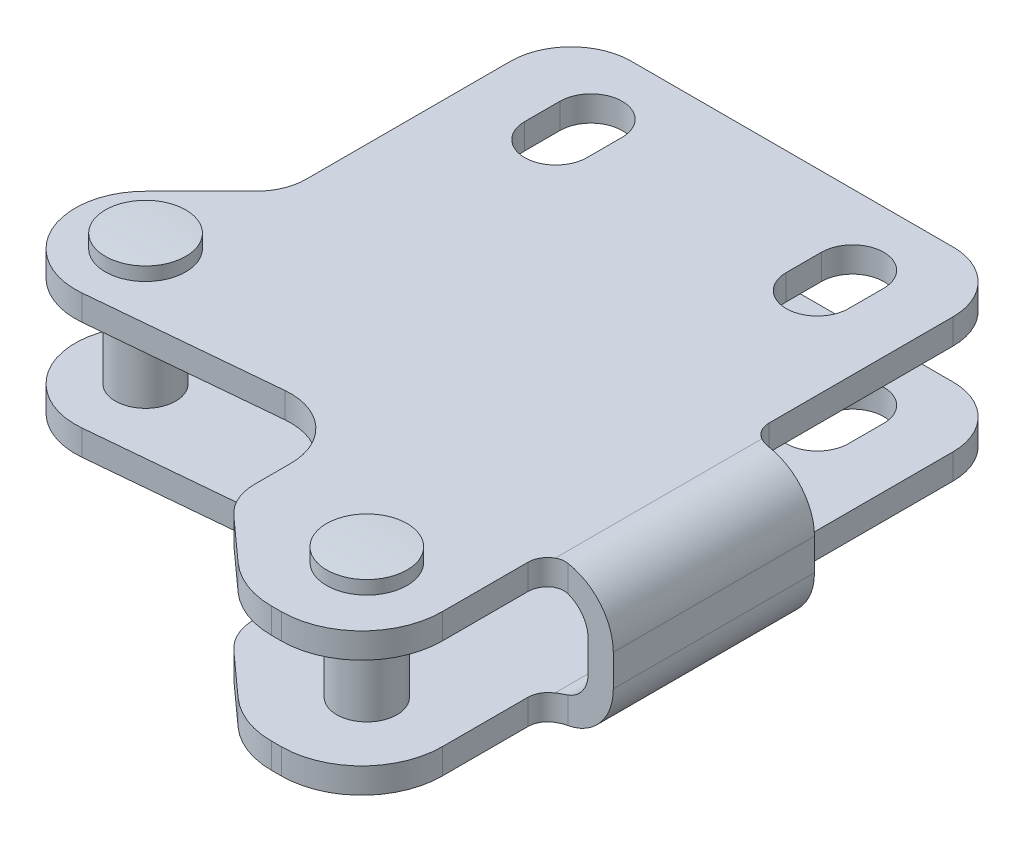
ISO-10303-21;
HEADER;
FILE_DESCRIPTION(('STEP AP214'),'2;1');
FILE_NAME('part.step','',(''),(''),'','','');
FILE_SCHEMA(('AUTOMOTIVE_DESIGN { 1 0 10303 214 1 1 1 1 }'));
ENDSEC;
DATA;
#1=APPLICATION_CONTEXT('core data for automotive mechanical design processes');
#2=APPLICATION_PROTOCOL_DEFINITION('international standard','automotive_design',2000,#1);
#3=PRODUCT_CONTEXT('',#1,'mechanical');
#4=PRODUCT('Part','Part','',(#3));
#5=PRODUCT_RELATED_PRODUCT_CATEGORY('part','',(#4));
#6=PRODUCT_DEFINITION_FORMATION('','',#4);
#7=PRODUCT_DEFINITION_CONTEXT('part definition',#1,'design');
#8=PRODUCT_DEFINITION('design','',#6,#7);
#9=PRODUCT_DEFINITION_SHAPE('','',#8);
#10=(LENGTH_UNIT() NAMED_UNIT(*) SI_UNIT(.MILLI.,.METRE.));
#11=(NAMED_UNIT(*) PLANE_ANGLE_UNIT() SI_UNIT($,.RADIAN.));
#12=(NAMED_UNIT(*) SI_UNIT($,.STERADIAN.) SOLID_ANGLE_UNIT());
#13=UNCERTAINTY_MEASURE_WITH_UNIT(LENGTH_MEASURE(1.E-05),#10,'distance_accuracy_value','');
#14=(GEOMETRIC_REPRESENTATION_CONTEXT(3) GLOBAL_UNCERTAINTY_ASSIGNED_CONTEXT((#13)) GLOBAL_UNIT_ASSIGNED_CONTEXT((#10,
#11,#12)) REPRESENTATION_CONTEXT('',''));
#15=CARTESIAN_POINT('',(0.,0.,0.));
#16=DIRECTION('',(0.,0.,1.));
#17=DIRECTION('',(1.,0.,0.));
#18=AXIS2_PLACEMENT_3D('',#15,#16,#17);
#19=CARTESIAN_POINT('',(35.,-7.075,17.29));
#20=DIRECTION('',(1.,0.,0.));
#21=DIRECTION('',(0.,1.,0.));
#22=AXIS2_PLACEMENT_3D('',#19,#20,#21);
#23=PLANE('',#22);
#24=DIRECTION('',(0.,1.,0.));
#25=VECTOR('',#24,1.);
#26=CARTESIAN_POINT('',(35.,-7.075,-1.));
#27=LINE('',#26,#25);
#28=CARTESIAN_POINT('',(35.,-7.075,-1.));
#29=VERTEX_POINT('',#28);
#30=CARTESIAN_POINT('',(35.,-4.55,-1.));
#31=VERTEX_POINT('',#30);
#32=EDGE_CURVE('E795',#29,#31,#27,.T.);
#33=ORIENTED_EDGE('',*,*,#32,.T.);
#34=DIRECTION('',(0.,0.,-1.));
#35=VECTOR('',#34,1.);
#36=CARTESIAN_POINT('',(35.,-4.55,17.29));
#37=LINE('',#36,#35);
#38=CARTESIAN_POINT('',(35.,-4.55,17.29));
#39=VERTEX_POINT('',#38);
#40=EDGE_CURVE('E894',#39,#31,#37,.T.);
#41=ORIENTED_EDGE('',*,*,#40,.F.);
#42=DIRECTION('',(0.,1.,0.));
#43=VECTOR('',#42,1.);
#44=CARTESIAN_POINT('',(35.,-7.075,17.29));
#45=LINE('',#44,#43);
#46=CARTESIAN_POINT('',(35.,-7.075,17.29));
#47=VERTEX_POINT('',#46);
#48=EDGE_CURVE('E799',#47,#39,#45,.T.);
#49=ORIENTED_EDGE('',*,*,#48,.F.);
#50=DIRECTION('',(0.,0.,-1.));
#51=VECTOR('',#50,1.);
#52=CARTESIAN_POINT('',(35.,-7.075,17.29));
#53=LINE('',#52,#51);
#54=EDGE_CURVE('E672',#47,#29,#53,.T.);
#55=ORIENTED_EDGE('',*,*,#54,.T.);
#56=EDGE_LOOP('',(#33,#41,#49,#55));
#57=FACE_BOUND('',#56,.T.);
#58=ADVANCED_FACE('F14',(#57),#23,.T.);
#59=CARTESIAN_POINT('',(29.,-7.075,-1.));
#60=DIRECTION('',(0.,1.,0.));
#61=DIRECTION('',(-1.,0.,0.));
#62=AXIS2_PLACEMENT_3D('',#59,#60,#61);
#63=CYLINDRICAL_SURFACE('',#62,6.);
#64=DIRECTION('',(0.,1.,0.));
#65=VECTOR('',#64,1.);
#66=CARTESIAN_POINT('',(29.,-7.075,-7.));
#67=LINE('',#66,#65);
#68=CARTESIAN_POINT('',(29.,-7.075,-7.));
#69=VERTEX_POINT('',#68);
#70=CARTESIAN_POINT('',(29.,-4.55,-7.));
#71=VERTEX_POINT('',#70);
#72=EDGE_CURVE('E791',#69,#71,#67,.T.);
#73=ORIENTED_EDGE('',*,*,#72,.T.);
#74=CARTESIAN_POINT('',(29.,-4.55,-1.));
#75=DIRECTION('',(0.,1.,0.));
#76=DIRECTION('',(-1.,0.,0.));
#77=AXIS2_PLACEMENT_3D('',#74,#75,#76);
#78=CIRCLE('',#77,6.);
#79=EDGE_CURVE('E896',#31,#71,#78,.T.);
#80=ORIENTED_EDGE('',*,*,#79,.F.);
#81=ORIENTED_EDGE('',*,*,#32,.F.);
#82=CARTESIAN_POINT('',(29.,-7.075,-1.));
#83=DIRECTION('',(0.,1.,0.));
#84=DIRECTION('',(-1.,0.,0.));
#85=AXIS2_PLACEMENT_3D('',#82,#83,#84);
#86=CIRCLE('',#85,6.);
#87=EDGE_CURVE('E675',#29,#69,#86,.T.);
#88=ORIENTED_EDGE('',*,*,#87,.T.);
#89=EDGE_LOOP('',(#73,#80,#81,#88));
#90=FACE_BOUND('',#89,.T.);
#91=ADVANCED_FACE('F1051',(#90),#63,.T.);
#92=CARTESIAN_POINT('',(29.,-7.075,-7.));
#93=DIRECTION('',(0.,0.,-1.));
#94=DIRECTION('',(0.,-1.,0.));
#95=AXIS2_PLACEMENT_3D('',#92,#93,#94);
#96=PLANE('',#95);
#97=DIRECTION('',(0.,1.,0.));
#98=VECTOR('',#97,1.);
#99=CARTESIAN_POINT('',(-3.,-7.075,-7.));
#100=LINE('',#99,#98);
#101=CARTESIAN_POINT('',(-3.,-7.075,-7.));
#102=VERTEX_POINT('',#101);
#103=CARTESIAN_POINT('',(-2.99999999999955,-4.55,-7.));
#104=VERTEX_POINT('',#103);
#105=EDGE_CURVE('E787',#102,#104,#100,.T.);
#106=ORIENTED_EDGE('',*,*,#105,.T.);
#107=DIRECTION('',(-1.,0.,0.));
#108=VECTOR('',#107,1.);
#109=CARTESIAN_POINT('',(29.,-4.55,-7.));
#110=LINE('',#109,#108);
#111=EDGE_CURVE('E898',#71,#104,#110,.T.);
#112=ORIENTED_EDGE('',*,*,#111,.F.);
#113=ORIENTED_EDGE('',*,*,#72,.F.);
#114=DIRECTION('',(-1.,0.,0.));
#115=VECTOR('',#114,1.);
#116=CARTESIAN_POINT('',(29.,-7.075,-7.));
#117=LINE('',#116,#115);
#118=EDGE_CURVE('E677',#69,#102,#117,.T.);
#119=ORIENTED_EDGE('',*,*,#118,.T.);
#120=EDGE_LOOP('',(#106,#112,#113,#119));
#121=FACE_BOUND('',#120,.T.);
#122=ADVANCED_FACE('F1057',(#121),#96,.T.);
#123=CARTESIAN_POINT('',(-2.99999999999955,-7.075,-0.99999999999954));
#124=DIRECTION('',(0.,1.,0.));
#125=DIRECTION('',(-1.,0.,0.));
#126=AXIS2_PLACEMENT_3D('',#123,#124,#125);
#127=CYLINDRICAL_SURFACE('',#126,6.00000000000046);
#128=DIRECTION('',(0.,1.,0.));
#129=VECTOR('',#128,1.);
#130=CARTESIAN_POINT('',(-9.,-7.075,-0.99999999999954));
#131=LINE('',#130,#129);
#132=CARTESIAN_POINT('',(-9.,-7.075,-0.99999999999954));
#133=VERTEX_POINT('',#132);
#134=CARTESIAN_POINT('',(-9.,-4.55,-0.99999999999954));
#135=VERTEX_POINT('',#134);
#136=EDGE_CURVE('E783',#133,#135,#131,.T.);
#137=ORIENTED_EDGE('',*,*,#136,.T.);
#138=CARTESIAN_POINT('',(-2.99999999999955,-4.55,-0.99999999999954));
#139=DIRECTION('',(0.,1.,0.));
#140=DIRECTION('',(-1.,0.,0.));
#141=AXIS2_PLACEMENT_3D('',#138,#139,#140);
#142=CIRCLE('',#141,6.00000000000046);
#143=EDGE_CURVE('E900',#104,#135,#142,.T.);
#144=ORIENTED_EDGE('',*,*,#143,.F.);
#145=ORIENTED_EDGE('',*,*,#105,.F.);
#146=CARTESIAN_POINT('',(-2.99999999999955,-7.075,-0.99999999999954));
#147=DIRECTION('',(0.,1.,0.));
#148=DIRECTION('',(1.,0.,0.));
#149=AXIS2_PLACEMENT_3D('',#146,#147,#148);
#150=CIRCLE('',#149,6.00000000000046);
#151=EDGE_CURVE('E680',#102,#133,#150,.T.);
#152=ORIENTED_EDGE('',*,*,#151,.T.);
#153=EDGE_LOOP('',(#137,#144,#145,#152));
#154=FACE_BOUND('',#153,.T.);
#155=ADVANCED_FACE('F1244',(#154),#127,.T.);
#156=CARTESIAN_POINT('',(-9.,-7.075,-1.));
#157=DIRECTION('',(-1.,0.,0.));
#158=DIRECTION('',(0.,-1.,0.));
#159=AXIS2_PLACEMENT_3D('',#156,#157,#158);
#160=PLANE('',#159);
#161=DIRECTION('',(0.,1.,0.));
#162=VECTOR('',#161,1.);
#163=CARTESIAN_POINT('',(-9.,-7.075,19.319437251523));
#164=LINE('',#163,#162);
#165=CARTESIAN_POINT('',(-9.,-7.075,19.319437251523));
#166=VERTEX_POINT('',#165);
#167=CARTESIAN_POINT('',(-9.,-4.55,19.319437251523));
#168=VERTEX_POINT('',#167);
#169=EDGE_CURVE('E779',#166,#168,#164,.T.);
#170=ORIENTED_EDGE('',*,*,#169,.T.);
#171=DIRECTION('',(0.,0.,1.));
#172=VECTOR('',#171,1.);
#173=CARTESIAN_POINT('',(-9.,-4.55,-0.99999999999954));
#174=LINE('',#173,#172);
#175=EDGE_CURVE('E902',#135,#168,#174,.T.);
#176=ORIENTED_EDGE('',*,*,#175,.F.);
#177=ORIENTED_EDGE('',*,*,#136,.F.);
#178=DIRECTION('',(0.,0.,1.));
#179=VECTOR('',#178,1.);
#180=CARTESIAN_POINT('',(-9.,-7.075,-1.));
#181=LINE('',#180,#179);
#182=EDGE_CURVE('E683',#133,#166,#181,.T.);
#183=ORIENTED_EDGE('',*,*,#182,.T.);
#184=EDGE_LOOP('',(#170,#176,#177,#183));
#185=FACE_BOUND('',#184,.T.);
#186=ADVANCED_FACE('F1251',(#185),#160,.T.);
#187=CARTESIAN_POINT('',(-14.0000000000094,-7.075,19.3194372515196));
#188=DIRECTION('',(0.,1.,0.));
#189=DIRECTION('',(-1.,0.,0.));
#190=AXIS2_PLACEMENT_3D('',#187,#188,#189);
#191=CYLINDRICAL_SURFACE('',#190,5.00000000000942);
#192=DIRECTION('',(0.,1.,0.));
#193=VECTOR('',#192,1.);
#194=CARTESIAN_POINT('',(-10.464466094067,-7.075,22.854971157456));
#195=LINE('',#194,#193);
#196=CARTESIAN_POINT('',(-10.464466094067,-7.075,22.854971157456));
#197=VERTEX_POINT('',#196);
#198=CARTESIAN_POINT('',(-10.464466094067,-4.55,22.854971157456));
#199=VERTEX_POINT('',#198);
#200=EDGE_CURVE('E775',#197,#199,#195,.T.);
#201=ORIENTED_EDGE('',*,*,#200,.T.);
#202=CARTESIAN_POINT('',(-14.0000000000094,-4.55,19.3194372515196));
#203=DIRECTION('',(0.,-1.,0.));
#204=DIRECTION('',(-1.,0.,0.));
#205=AXIS2_PLACEMENT_3D('',#202,#203,#204);
#206=CIRCLE('',#205,5.00000000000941);
#207=EDGE_CURVE('E904',#168,#199,#206,.T.);
#208=ORIENTED_EDGE('',*,*,#207,.F.);
#209=ORIENTED_EDGE('',*,*,#169,.F.);
#210=CARTESIAN_POINT('',(-14.0000000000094,-7.075,19.3194372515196));
#211=DIRECTION('',(0.,-1.,0.));
#212=DIRECTION('',(-1.,0.,0.));
#213=AXIS2_PLACEMENT_3D('',#210,#211,#212);
#214=CIRCLE('',#213,5.00000000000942);
#215=EDGE_CURVE('E686',#166,#197,#214,.T.);
#216=ORIENTED_EDGE('',*,*,#215,.T.);
#217=EDGE_LOOP('',(#201,#208,#209,#216));
#218=FACE_BOUND('',#217,.T.);
#219=ADVANCED_FACE('F1265',(#218),#191,.F.);
#220=CARTESIAN_POINT('',(-10.464466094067,-7.075,22.854971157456));
#221=DIRECTION('',(-0.707106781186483,0.,-0.707106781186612));
#222=DIRECTION('',(-0.707106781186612,0.,0.707106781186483));
#223=AXIS2_PLACEMENT_3D('',#220,#221,#222);
#224=PLANE('',#223);
#225=DIRECTION('',(0.,1.,0.));
#226=VECTOR('',#225,1.);
#227=CARTESIAN_POINT('',(-15.949747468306,-7.075,28.340252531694));
#228=LINE('',#227,#226);
#229=CARTESIAN_POINT('',(-15.949747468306,-7.075,28.340252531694));
#230=VERTEX_POINT('',#229);
#231=CARTESIAN_POINT('',(-15.949747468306,-4.55,28.340252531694));
#232=VERTEX_POINT('',#231);
#233=EDGE_CURVE('E771',#230,#232,#228,.T.);
#234=ORIENTED_EDGE('',*,*,#233,.T.);
#235=DIRECTION('',(-0.707106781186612,0.,0.707106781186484));
#236=VECTOR('',#235,1.);
#237=CARTESIAN_POINT('',(-10.464466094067,-4.55,22.854971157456));
#238=LINE('',#237,#236);
#239=EDGE_CURVE('E906',#199,#232,#238,.T.);
#240=ORIENTED_EDGE('',*,*,#239,.F.);
#241=ORIENTED_EDGE('',*,*,#200,.F.);
#242=DIRECTION('',(-0.707106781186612,0.,0.707106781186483));
#243=VECTOR('',#242,1.);
#244=CARTESIAN_POINT('',(-10.464466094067,-7.075,22.854971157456));
#245=LINE('',#244,#243);
#246=EDGE_CURVE('E689',#197,#230,#245,.T.);
#247=ORIENTED_EDGE('',*,*,#246,.T.);
#248=EDGE_LOOP('',(#234,#240,#241,#247));
#249=FACE_BOUND('',#248,.T.);
#250=ADVANCED_FACE('F1270',(#249),#224,.T.);
#251=CARTESIAN_POINT('',(-11.,-7.075,33.29));
#252=DIRECTION('',(0.,1.,0.));
#253=DIRECTION('',(-1.,0.,0.));
#254=AXIS2_PLACEMENT_3D('',#251,#252,#253);
#255=CYLINDRICAL_SURFACE('',#254,7.);
#256=DIRECTION('',(0.,1.,0.));
#257=VECTOR('',#256,1.);
#258=CARTESIAN_POINT('',(-10.361508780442,-7.075,40.260819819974));
#259=LINE('',#258,#257);
#260=CARTESIAN_POINT('',(-10.361508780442,-7.075,40.260819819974));
#261=VERTEX_POINT('',#260);
#262=CARTESIAN_POINT('',(-10.361508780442,-4.55,40.2608198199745));
#263=VERTEX_POINT('',#262);
#264=EDGE_CURVE('E767',#261,#263,#259,.T.);
#265=ORIENTED_EDGE('',*,*,#264,.T.);
#266=CARTESIAN_POINT('',(-11.,-4.55,33.29));
#267=DIRECTION('',(0.,1.,0.));
#268=DIRECTION('',(-1.,0.,0.));
#269=AXIS2_PLACEMENT_3D('',#266,#267,#268);
#270=CIRCLE('',#269,7.00000000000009);
#271=EDGE_CURVE('E908',#232,#263,#270,.T.);
#272=ORIENTED_EDGE('',*,*,#271,.F.);
#273=ORIENTED_EDGE('',*,*,#233,.F.);
#274=CARTESIAN_POINT('',(-11.,-7.075,33.29));
#275=DIRECTION('',(0.,1.,0.));
#276=DIRECTION('',(1.,0.,0.));
#277=AXIS2_PLACEMENT_3D('',#274,#275,#276);
#278=CIRCLE('',#277,7.);
#279=EDGE_CURVE('E692',#230,#261,#278,.T.);
#280=ORIENTED_EDGE('',*,*,#279,.T.);
#281=EDGE_LOOP('',(#265,#272,#273,#280));
#282=FACE_BOUND('',#281,.T.);
#283=ADVANCED_FACE('F1273',(#282),#255,.T.);
#284=CARTESIAN_POINT('',(-10.361508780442,-7.075,40.260819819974));
#285=DIRECTION('',(0.0912130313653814,0.,0.995831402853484));
#286=DIRECTION('',(0.995831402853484,0.,-0.0912130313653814));
#287=AXIS2_PLACEMENT_3D('',#284,#285,#286);
#288=PLANE('',#287);
#289=DIRECTION('',(0.,1.,0.));
#290=VECTOR('',#289,1.);
#291=CARTESIAN_POINT('',(8.152721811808,-7.075,38.565011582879));
#292=LINE('',#291,#290);
#293=CARTESIAN_POINT('',(8.152721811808,-7.075,38.565011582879));
#294=VERTEX_POINT('',#293);
#295=CARTESIAN_POINT('',(8.152721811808,-4.55,38.565011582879));
#296=VERTEX_POINT('',#295);
#297=EDGE_CURVE('E763',#294,#296,#292,.T.);
#298=ORIENTED_EDGE('',*,*,#297,.T.);
#299=DIRECTION('',(0.995831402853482,0.,-0.0912130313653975));
#300=VECTOR('',#299,1.);
#301=CARTESIAN_POINT('',(-10.361508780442,-4.55,40.2608198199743));
#302=LINE('',#301,#300);
#303=EDGE_CURVE('E910',#263,#296,#302,.T.);
#304=ORIENTED_EDGE('',*,*,#303,.F.);
#305=ORIENTED_EDGE('',*,*,#264,.F.);
#306=DIRECTION('',(0.995831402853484,0.,-0.0912130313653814));
#307=VECTOR('',#306,1.);
#308=CARTESIAN_POINT('',(-10.361508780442,-7.075,40.260819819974));
#309=LINE('',#308,#307);
#310=EDGE_CURVE('E695',#261,#294,#309,.T.);
#311=ORIENTED_EDGE('',*,*,#310,.T.);
#312=EDGE_LOOP('',(#298,#304,#305,#311));
#313=FACE_BOUND('',#312,.T.);
#314=ADVANCED_FACE('F1278',(#313),#288,.T.);
#315=CARTESIAN_POINT('',(8.70000000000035,-7.075,44.54));
#316=DIRECTION('',(0.,1.,0.));
#317=DIRECTION('',(-1.,0.,0.));
#318=AXIS2_PLACEMENT_3D('',#315,#316,#317);
#319=CYLINDRICAL_SURFACE('',#318,5.99999999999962);
#320=DIRECTION('',(0.,1.,0.));
#321=VECTOR('',#320,1.);
#322=CARTESIAN_POINT('',(14.7,-7.075,44.54));
#323=LINE('',#322,#321);
#324=CARTESIAN_POINT('',(14.7,-7.075,44.54));
#325=VERTEX_POINT('',#324);
#326=CARTESIAN_POINT('',(14.7000000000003,-4.55,44.54));
#327=VERTEX_POINT('',#326);
#328=EDGE_CURVE('E759',#325,#327,#323,.T.);
#329=ORIENTED_EDGE('',*,*,#328,.T.);
#330=CARTESIAN_POINT('',(8.70000000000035,-4.55,44.54));
#331=DIRECTION('',(0.,-1.,0.));
#332=DIRECTION('',(-1.,0.,0.));
#333=AXIS2_PLACEMENT_3D('',#330,#331,#332);
#334=CIRCLE('',#333,6.);
#335=EDGE_CURVE('E912',#296,#327,#334,.T.);
#336=ORIENTED_EDGE('',*,*,#335,.F.);
#337=ORIENTED_EDGE('',*,*,#297,.F.);
#338=CARTESIAN_POINT('',(8.70000000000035,-7.075,44.54));
#339=DIRECTION('',(0.,-1.,0.));
#340=DIRECTION('',(-1.,0.,0.));
#341=AXIS2_PLACEMENT_3D('',#338,#339,#340);
#342=CIRCLE('',#341,5.99999999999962);
#343=EDGE_CURVE('E698',#294,#325,#342,.T.);
#344=ORIENTED_EDGE('',*,*,#343,.T.);
#345=EDGE_LOOP('',(#329,#336,#337,#344));
#346=FACE_BOUND('',#345,.T.);
#347=ADVANCED_FACE('F1281',(#346),#319,.F.);
#348=CARTESIAN_POINT('',(14.7,-7.075,44.54));
#349=DIRECTION('',(-1.,0.,0.));
#350=DIRECTION('',(0.,-1.,0.));
#351=AXIS2_PLACEMENT_3D('',#348,#349,#350);
#352=PLANE('',#351);
#353=DIRECTION('',(0.,1.,0.));
#354=VECTOR('',#353,1.);
#355=CARTESIAN_POINT('',(14.7,-7.075,48.154352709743));
#356=LINE('',#355,#354);
#357=CARTESIAN_POINT('',(14.7,-7.075,48.154352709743));
#358=VERTEX_POINT('',#357);
#359=CARTESIAN_POINT('',(14.7,-4.55,48.1543527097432));
#360=VERTEX_POINT('',#359);
#361=EDGE_CURVE('E755',#358,#360,#356,.T.);
#362=ORIENTED_EDGE('',*,*,#361,.T.);
#363=DIRECTION('',(0.,0.,1.));
#364=VECTOR('',#363,1.);
#365=CARTESIAN_POINT('',(14.7000000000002,-4.55,44.54));
#366=LINE('',#365,#364);
#367=EDGE_CURVE('E914',#327,#360,#366,.T.);
#368=ORIENTED_EDGE('',*,*,#367,.F.);
#369=ORIENTED_EDGE('',*,*,#328,.F.);
#370=DIRECTION('',(0.,0.,1.));
#371=VECTOR('',#370,1.);
#372=CARTESIAN_POINT('',(14.7,-7.075,44.54));
#373=LINE('',#372,#371);
#374=EDGE_CURVE('E701',#325,#358,#373,.T.);
#375=ORIENTED_EDGE('',*,*,#374,.T.);
#376=EDGE_LOOP('',(#362,#368,#369,#375));
#377=FACE_BOUND('',#376,.T.);
#378=ADVANCED_FACE('F1286',(#377),#352,.T.);
#379=CARTESIAN_POINT('',(19.6999999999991,-7.075,48.1543527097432));
#380=DIRECTION('',(0.,1.,0.));
#381=DIRECTION('',(-1.,0.,0.));
#382=AXIS2_PLACEMENT_3D('',#379,#380,#381);
#383=CYLINDRICAL_SURFACE('',#382,4.99999999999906);
#384=DIRECTION('',(0.,1.,0.));
#385=VECTOR('',#384,1.);
#386=CARTESIAN_POINT('',(16.354346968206,-7.075,51.87007683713));
#387=LINE('',#386,#385);
#388=CARTESIAN_POINT('',(16.354346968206,-7.075,51.87007683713));
#389=VERTEX_POINT('',#388);
#390=CARTESIAN_POINT('',(16.354346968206,-4.55,51.87007683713));
#391=VERTEX_POINT('',#390);
#392=EDGE_CURVE('E751',#389,#391,#387,.T.);
#393=ORIENTED_EDGE('',*,*,#392,.T.);
#394=CARTESIAN_POINT('',(19.6999999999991,-4.55,48.1543527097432));
#395=DIRECTION('',(0.,1.,0.));
#396=DIRECTION('',(-1.,0.,0.));
#397=AXIS2_PLACEMENT_3D('',#394,#395,#396);
#398=CIRCLE('',#397,4.99999999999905);
#399=EDGE_CURVE('E916',#360,#391,#398,.T.);
#400=ORIENTED_EDGE('',*,*,#399,.F.);
#401=ORIENTED_EDGE('',*,*,#361,.F.);
#402=CARTESIAN_POINT('',(19.6999999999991,-7.075,48.1543527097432));
#403=DIRECTION('',(0.,1.,0.));
#404=DIRECTION('',(-1.,0.,0.));
#405=AXIS2_PLACEMENT_3D('',#402,#403,#404);
#406=CIRCLE('',#405,4.99999999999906);
#407=EDGE_CURVE('E704',#358,#389,#406,.T.);
#408=ORIENTED_EDGE('',*,*,#407,.T.);
#409=EDGE_LOOP('',(#393,#400,#401,#408));
#410=FACE_BOUND('',#409,.T.);
#411=ADVANCED_FACE('F1289',(#410),#383,.T.);
#412=CARTESIAN_POINT('',(16.354346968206,-7.075,51.87007683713));
#413=DIRECTION('',(-0.669130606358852,0.,0.7431448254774));
#414=DIRECTION('',(0.7431448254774,0.,0.669130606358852));
#415=AXIS2_PLACEMENT_3D('',#412,#413,#414);
#416=PLANE('',#415);
#417=DIRECTION('',(0.,1.,0.));
#418=VECTOR('',#417,1.);
#419=CARTESIAN_POINT('',(20.646955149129,-7.075,55.735158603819));
#420=LINE('',#419,#418);
#421=CARTESIAN_POINT('',(20.646955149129,-7.075,55.735158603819));
#422=VERTEX_POINT('',#421);
#423=CARTESIAN_POINT('',(20.646955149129,-4.55,55.735158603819));
#424=VERTEX_POINT('',#423);
#425=EDGE_CURVE('E747',#422,#424,#420,.T.);
#426=ORIENTED_EDGE('',*,*,#425,.T.);
#427=DIRECTION('',(0.7431448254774,0.,0.669130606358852));
#428=VECTOR('',#427,1.);
#429=CARTESIAN_POINT('',(16.354346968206,-4.55,51.87007683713));
#430=LINE('',#429,#428);
#431=EDGE_CURVE('E918',#391,#424,#430,.T.);
#432=ORIENTED_EDGE('',*,*,#431,.F.);
#433=ORIENTED_EDGE('',*,*,#392,.F.);
#434=DIRECTION('',(0.7431448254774,0.,0.669130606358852));
#435=VECTOR('',#434,1.);
#436=CARTESIAN_POINT('',(16.354346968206,-7.075,51.87007683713));
#437=LINE('',#436,#435);
#438=EDGE_CURVE('E707',#389,#422,#437,.T.);
#439=ORIENTED_EDGE('',*,*,#438,.T.);
#440=EDGE_LOOP('',(#426,#432,#433,#439));
#441=FACE_BOUND('',#440,.T.);
#442=ADVANCED_FACE('F1294',(#441),#416,.T.);
#443=CARTESIAN_POINT('',(25.9999999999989,-7.075,49.7900000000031));
#444=DIRECTION('',(0.,1.,0.));
#445=DIRECTION('',(-1.,0.,0.));
#446=AXIS2_PLACEMENT_3D('',#443,#444,#445);
#447=CYLINDRICAL_SURFACE('',#446,7.99999999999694);
#448=DIRECTION('',(0.,1.,0.));
#449=VECTOR('',#448,1.);
#450=CARTESIAN_POINT('',(26.,-7.075,57.79));
#451=LINE('',#450,#449);
#452=CARTESIAN_POINT('',(26.,-7.075,57.79));
#453=VERTEX_POINT('',#452);
#454=CARTESIAN_POINT('',(26.,-4.55,57.79));
#455=VERTEX_POINT('',#454);
#456=EDGE_CURVE('E743',#453,#455,#451,.T.);
#457=ORIENTED_EDGE('',*,*,#456,.T.);
#458=CARTESIAN_POINT('',(25.9999999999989,-4.55,49.7900000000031));
#459=DIRECTION('',(0.,1.,0.));
#460=DIRECTION('',(-1.,0.,0.));
#461=AXIS2_PLACEMENT_3D('',#458,#459,#460);
#462=CIRCLE('',#461,7.9999999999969);
#463=EDGE_CURVE('E920',#424,#455,#462,.T.);
#464=ORIENTED_EDGE('',*,*,#463,.F.);
#465=ORIENTED_EDGE('',*,*,#425,.F.);
#466=CARTESIAN_POINT('',(25.9999999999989,-7.075,49.7900000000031));
#467=DIRECTION('',(0.,1.,0.));
#468=DIRECTION('',(-1.,0.,0.));
#469=AXIS2_PLACEMENT_3D('',#466,#467,#468);
#470=CIRCLE('',#469,7.99999999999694);
#471=EDGE_CURVE('E710',#422,#453,#470,.T.);
#472=ORIENTED_EDGE('',*,*,#471,.T.);
#473=EDGE_LOOP('',(#457,#464,#465,#472));
#474=FACE_BOUND('',#473,.T.);
#475=ADVANCED_FACE('F1297',(#474),#447,.T.);
#476=CARTESIAN_POINT('',(26.,-7.075,57.79));
#477=DIRECTION('',(0.,0.,1.));
#478=DIRECTION('',(0.,1.,0.));
#479=AXIS2_PLACEMENT_3D('',#476,#477,#478);
#480=PLANE('',#479);
#481=DIRECTION('',(0.,1.,0.));
#482=VECTOR('',#481,1.);
#483=CARTESIAN_POINT('',(27.,-7.075,57.79));
#484=LINE('',#483,#482);
#485=CARTESIAN_POINT('',(27.,-7.075,57.79));
#486=VERTEX_POINT('',#485);
#487=CARTESIAN_POINT('',(27.,-4.55,57.79));
#488=VERTEX_POINT('',#487);
#489=EDGE_CURVE('E739',#486,#488,#484,.T.);
#490=ORIENTED_EDGE('',*,*,#489,.T.);
#491=DIRECTION('',(1.,0.,0.));
#492=VECTOR('',#491,1.);
#493=CARTESIAN_POINT('',(26.,-4.55,57.79));
#494=LINE('',#493,#492);
#495=EDGE_CURVE('E922',#455,#488,#494,.T.);
#496=ORIENTED_EDGE('',*,*,#495,.F.);
#497=ORIENTED_EDGE('',*,*,#456,.F.);
#498=DIRECTION('',(1.,0.,0.));
#499=VECTOR('',#498,1.);
#500=CARTESIAN_POINT('',(26.,-7.075,57.79));
#501=LINE('',#500,#499);
#502=EDGE_CURVE('E713',#453,#486,#501,.T.);
#503=ORIENTED_EDGE('',*,*,#502,.T.);
#504=EDGE_LOOP('',(#490,#496,#497,#503));
#505=FACE_BOUND('',#504,.T.);
#506=ADVANCED_FACE('F1302',(#505),#480,.T.);
#507=CARTESIAN_POINT('',(26.9999999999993,-7.075,49.79));
#508=DIRECTION('',(0.,1.,0.));
#509=DIRECTION('',(-1.,0.,0.));
#510=AXIS2_PLACEMENT_3D('',#507,#508,#509);
#511=CYLINDRICAL_SURFACE('',#510,8.00000000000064);
#512=DIRECTION('',(0.,1.,0.));
#513=VECTOR('',#512,1.);
#514=CARTESIAN_POINT('',(35.,-7.075,49.79));
#515=LINE('',#514,#513);
#516=CARTESIAN_POINT('',(35.,-7.075,49.79));
#517=VERTEX_POINT('',#516);
#518=CARTESIAN_POINT('',(34.9999999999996,-4.55,49.79));
#519=VERTEX_POINT('',#518);
#520=EDGE_CURVE('E735',#517,#519,#515,.T.);
#521=ORIENTED_EDGE('',*,*,#520,.T.);
#522=CARTESIAN_POINT('',(26.9999999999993,-4.55,49.79));
#523=DIRECTION('',(0.,1.,0.));
#524=DIRECTION('',(-1.,0.,0.));
#525=AXIS2_PLACEMENT_3D('',#522,#523,#524);
#526=CIRCLE('',#525,8.00000000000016);
#527=EDGE_CURVE('E924',#488,#519,#526,.T.);
#528=ORIENTED_EDGE('',*,*,#527,.F.);
#529=ORIENTED_EDGE('',*,*,#489,.F.);
#530=CARTESIAN_POINT('',(26.9999999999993,-7.075,49.79));
#531=DIRECTION('',(0.,1.,0.));
#532=DIRECTION('',(-1.,0.,0.));
#533=AXIS2_PLACEMENT_3D('',#530,#531,#532);
#534=CIRCLE('',#533,8.00000000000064);
#535=EDGE_CURVE('E716',#486,#517,#534,.T.);
#536=ORIENTED_EDGE('',*,*,#535,.T.);
#537=EDGE_LOOP('',(#521,#528,#529,#536));
#538=FACE_BOUND('',#537,.T.);
#539=ADVANCED_FACE('F1304',(#538),#511,.T.);
#540=CARTESIAN_POINT('',(35.,-7.075,49.79));
#541=DIRECTION('',(1.,0.,0.));
#542=DIRECTION('',(0.,1.,0.));
#543=AXIS2_PLACEMENT_3D('',#540,#541,#542);
#544=PLANE('',#543);
#545=DIRECTION('',(0.,1.,0.));
#546=VECTOR('',#545,1.);
#547=CARTESIAN_POINT('',(35.,-7.075,41.29));
#548=LINE('',#547,#546);
#549=CARTESIAN_POINT('',(35.,-7.075,41.29));
#550=VERTEX_POINT('',#549);
#551=CARTESIAN_POINT('',(35.,-4.55,41.29));
#552=VERTEX_POINT('',#551);
#553=EDGE_CURVE('E731',#550,#552,#548,.T.);
#554=ORIENTED_EDGE('',*,*,#553,.T.);
#555=DIRECTION('',(0.,0.,-1.));
#556=VECTOR('',#555,1.);
#557=CARTESIAN_POINT('',(35.,-4.55,49.79));
#558=LINE('',#557,#556);
#559=EDGE_CURVE('E926',#519,#552,#558,.T.);
#560=ORIENTED_EDGE('',*,*,#559,.F.);
#561=ORIENTED_EDGE('',*,*,#520,.F.);
#562=DIRECTION('',(0.,0.,-1.));
#563=VECTOR('',#562,1.);
#564=CARTESIAN_POINT('',(35.,-7.075,49.79));
#565=LINE('',#564,#563);
#566=EDGE_CURVE('E718',#517,#550,#565,.T.);
#567=ORIENTED_EDGE('',*,*,#566,.T.);
#568=EDGE_LOOP('',(#554,#560,#561,#567));
#569=FACE_BOUND('',#568,.T.);
#570=ADVANCED_FACE('F1308',(#569),#544,.T.);
#571=CARTESIAN_POINT('',(22.9,-7.075,0.));
#572=DIRECTION('',(-1.,0.,0.));
#573=DIRECTION('',(0.,-1.,0.));
#574=AXIS2_PLACEMENT_3D('',#571,#572,#573);
#575=PLANE('',#574);
#576=DIRECTION('',(0.,0.,1.));
#577=VECTOR('',#576,1.);
#578=CARTESIAN_POINT('',(22.9,-4.55,0.));
#579=LINE('',#578,#577);
#580=CARTESIAN_POINT('',(22.9,-4.55,0.));
#581=VERTEX_POINT('',#580);
#582=CARTESIAN_POINT('',(22.9,-4.55,3.5));
#583=VERTEX_POINT('',#582);
#584=EDGE_CURVE('E883',#581,#583,#579,.T.);
#585=ORIENTED_EDGE('',*,*,#584,.T.);
#586=DIRECTION('',(0.,1.,0.));
#587=VECTOR('',#586,1.);
#588=CARTESIAN_POINT('',(22.9,-7.075,3.5));
#589=LINE('',#588,#587);
#590=CARTESIAN_POINT('',(22.9,-7.075,3.5));
#591=VERTEX_POINT('',#590);
#592=EDGE_CURVE('E496',#591,#583,#589,.T.);
#593=ORIENTED_EDGE('',*,*,#592,.F.);
#594=DIRECTION('',(0.,0.,1.));
#595=VECTOR('',#594,1.);
#596=CARTESIAN_POINT('',(22.9,-7.075,0.));
#597=LINE('',#596,#595);
#598=CARTESIAN_POINT('',(22.9,-7.075,0.));
#599=VERTEX_POINT('',#598);
#600=EDGE_CURVE('E493',#599,#591,#597,.T.);
#601=ORIENTED_EDGE('',*,*,#600,.F.);
#602=DIRECTION('',(0.,1.,0.));
#603=VECTOR('',#602,1.);
#604=CARTESIAN_POINT('',(22.9,-7.075,0.));
#605=LINE('',#604,#603);
#606=EDGE_CURVE('E501',#599,#581,#605,.T.);
#607=ORIENTED_EDGE('',*,*,#606,.T.);
#608=EDGE_LOOP('',(#585,#593,#601,#607));
#609=FACE_BOUND('',#608,.T.);
#610=ADVANCED_FACE('F1310',(#609),#575,.F.);
#611=CARTESIAN_POINT('',(26.,-7.075,0.));
#612=DIRECTION('',(0.,1.,0.));
#613=DIRECTION('',(-1.,0.,0.));
#614=AXIS2_PLACEMENT_3D('',#611,#612,#613);
#615=CYLINDRICAL_SURFACE('',#614,3.1);
#616=CARTESIAN_POINT('',(26.,-4.55,0.));
#617=DIRECTION('',(0.,1.,0.));
#618=DIRECTION('',(-1.,0.,0.));
#619=AXIS2_PLACEMENT_3D('',#616,#617,#618);
#620=CIRCLE('',#619,3.1);
#621=CARTESIAN_POINT('',(29.1,-4.55,0.));
#622=VERTEX_POINT('',#621);
#623=EDGE_CURVE('E880',#622,#581,#620,.T.);
#624=ORIENTED_EDGE('',*,*,#623,.T.);
#625=ORIENTED_EDGE('',*,*,#606,.F.);
#626=CARTESIAN_POINT('',(26.,-7.075,0.));
#627=DIRECTION('',(0.,1.,0.));
#628=DIRECTION('',(1.,0.,0.));
#629=AXIS2_PLACEMENT_3D('',#626,#627,#628);
#630=CIRCLE('',#629,3.1);
#631=CARTESIAN_POINT('',(29.1,-7.075,0.));
#632=VERTEX_POINT('',#631);
#633=EDGE_CURVE('E490',#632,#599,#630,.T.);
#634=ORIENTED_EDGE('',*,*,#633,.F.);
#635=DIRECTION('',(0.,1.,0.));
#636=VECTOR('',#635,1.);
#637=CARTESIAN_POINT('',(29.1,-7.075,0.));
#638=LINE('',#637,#636);
#639=EDGE_CURVE('E504',#632,#622,#638,.T.);
#640=ORIENTED_EDGE('',*,*,#639,.T.);
#641=EDGE_LOOP('',(#624,#625,#634,#640));
#642=FACE_BOUND('',#641,.T.);
#643=ADVANCED_FACE('F1316',(#642),#615,.F.);
#644=CARTESIAN_POINT('',(29.1,-7.075,3.5));
#645=DIRECTION('',(1.,0.,0.));
#646=DIRECTION('',(0.,1.,0.));
#647=AXIS2_PLACEMENT_3D('',#644,#645,#646);
#648=PLANE('',#647);
#649=DIRECTION('',(0.,0.,-1.));
#650=VECTOR('',#649,1.);
#651=CARTESIAN_POINT('',(29.1,-4.55,3.5));
#652=LINE('',#651,#650);
#653=CARTESIAN_POINT('',(29.1,-4.55,3.5));
#654=VERTEX_POINT('',#653);
#655=EDGE_CURVE('E31',#654,#622,#652,.T.);
#656=ORIENTED_EDGE('',*,*,#655,.T.);
#657=ORIENTED_EDGE('',*,*,#639,.F.);
#658=DIRECTION('',(0.,0.,-1.));
#659=VECTOR('',#658,1.);
#660=CARTESIAN_POINT('',(29.1,-7.075,3.5));
#661=LINE('',#660,#659);
#662=CARTESIAN_POINT('',(29.1,-7.075,3.5));
#663=VERTEX_POINT('',#662);
#664=EDGE_CURVE('E487',#663,#632,#661,.T.);
#665=ORIENTED_EDGE('',*,*,#664,.F.);
#666=DIRECTION('',(0.,1.,0.));
#667=VECTOR('',#666,1.);
#668=CARTESIAN_POINT('',(29.1,-7.075,3.5));
#669=LINE('',#668,#667);
#670=EDGE_CURVE('E507',#663,#654,#669,.T.);
#671=ORIENTED_EDGE('',*,*,#670,.T.);
#672=EDGE_LOOP('',(#656,#657,#665,#671));
#673=FACE_BOUND('',#672,.T.);
#674=ADVANCED_FACE('F1595',(#673),#648,.F.);
#675=CARTESIAN_POINT('',(26.,-7.075,3.5));
#676=DIRECTION('',(0.,1.,0.));
#677=DIRECTION('',(-1.,0.,0.));
#678=AXIS2_PLACEMENT_3D('',#675,#676,#677);
#679=CYLINDRICAL_SURFACE('',#678,3.1);
#680=CARTESIAN_POINT('',(26.,-4.55,3.5));
#681=DIRECTION('',(0.,1.,0.));
#682=DIRECTION('',(-1.,0.,0.));
#683=AXIS2_PLACEMENT_3D('',#680,#681,#682);
#684=CIRCLE('',#683,3.1);
#685=EDGE_CURVE('E442',#583,#654,#684,.T.);
#686=ORIENTED_EDGE('',*,*,#685,.T.);
#687=ORIENTED_EDGE('',*,*,#670,.F.);
#688=CARTESIAN_POINT('',(26.,-7.075,3.5));
#689=DIRECTION('',(0.,1.,0.));
#690=DIRECTION('',(-1.,0.,0.));
#691=AXIS2_PLACEMENT_3D('',#688,#689,#690);
#692=CIRCLE('',#691,3.1);
#693=EDGE_CURVE('E486',#591,#663,#692,.T.);
#694=ORIENTED_EDGE('',*,*,#693,.F.);
#695=ORIENTED_EDGE('',*,*,#592,.T.);
#696=EDGE_LOOP('',(#686,#687,#694,#695));
#697=FACE_BOUND('',#696,.T.);
#698=ADVANCED_FACE('F1608',(#697),#679,.F.);
#699=CARTESIAN_POINT('',(-3.1,-7.075,0.));
#700=DIRECTION('',(-1.,0.,0.));
#701=DIRECTION('',(0.,-1.,0.));
#702=AXIS2_PLACEMENT_3D('',#699,#700,#701);
#703=PLANE('',#702);
#704=DIRECTION('',(0.,0.,1.));
#705=VECTOR('',#704,1.);
#706=CARTESIAN_POINT('',(-3.1,-4.55,0.));
#707=LINE('',#706,#705);
#708=CARTESIAN_POINT('',(-3.1,-4.55,0.));
#709=VERTEX_POINT('',#708);
#710=CARTESIAN_POINT('',(-3.1,-4.55,3.5));
#711=VERTEX_POINT('',#710);
#712=EDGE_CURVE('E433',#709,#711,#707,.T.);
#713=ORIENTED_EDGE('',*,*,#712,.T.);
#714=DIRECTION('',(0.,1.,0.));
#715=VECTOR('',#714,1.);
#716=CARTESIAN_POINT('',(-3.1,-7.075,3.5));
#717=LINE('',#716,#715);
#718=CARTESIAN_POINT('',(-3.1,-7.075,3.5));
#719=VERTEX_POINT('',#718);
#720=EDGE_CURVE('E456',#719,#711,#717,.T.);
#721=ORIENTED_EDGE('',*,*,#720,.F.);
#722=DIRECTION('',(0.,0.,1.));
#723=VECTOR('',#722,1.);
#724=CARTESIAN_POINT('',(-3.1,-7.075,0.));
#725=LINE('',#724,#723);
#726=CARTESIAN_POINT('',(-3.1,-7.075,0.));
#727=VERTEX_POINT('',#726);
#728=EDGE_CURVE('E454',#727,#719,#725,.T.);
#729=ORIENTED_EDGE('',*,*,#728,.F.);
#730=DIRECTION('',(0.,1.,0.));
#731=VECTOR('',#730,1.);
#732=CARTESIAN_POINT('',(-3.1,-7.075,0.));
#733=LINE('',#732,#731);
#734=EDGE_CURVE('E448',#727,#709,#733,.T.);
#735=ORIENTED_EDGE('',*,*,#734,.T.);
#736=EDGE_LOOP('',(#713,#721,#729,#735));
#737=FACE_BOUND('',#736,.T.);
#738=ADVANCED_FACE('F452',(#737),#703,.F.);
#739=CARTESIAN_POINT('',(0.,-7.075,0.));
#740=DIRECTION('',(0.,1.,0.));
#741=DIRECTION('',(-1.,0.,0.));
#742=AXIS2_PLACEMENT_3D('',#739,#740,#741);
#743=CYLINDRICAL_SURFACE('',#742,3.1);
#744=CARTESIAN_POINT('',(0.,-4.55,0.));
#745=DIRECTION('',(0.,1.,0.));
#746=DIRECTION('',(-1.,0.,0.));
#747=AXIS2_PLACEMENT_3D('',#744,#745,#746);
#748=CIRCLE('',#747,3.1);
#749=CARTESIAN_POINT('',(3.1,-4.55,0.));
#750=VERTEX_POINT('',#749);
#751=EDGE_CURVE('E436',#750,#709,#748,.T.);
#752=ORIENTED_EDGE('',*,*,#751,.T.);
#753=ORIENTED_EDGE('',*,*,#734,.F.);
#754=CARTESIAN_POINT('',(0.,-7.075,0.));
#755=DIRECTION('',(0.,1.,0.));
#756=DIRECTION('',(1.,0.,0.));
#757=AXIS2_PLACEMENT_3D('',#754,#755,#756);
#758=CIRCLE('',#757,3.1);
#759=CARTESIAN_POINT('',(3.1,-7.075,0.));
#760=VERTEX_POINT('',#759);
#761=EDGE_CURVE('E864',#760,#727,#758,.T.);
#762=ORIENTED_EDGE('',*,*,#761,.F.);
#763=DIRECTION('',(0.,1.,0.));
#764=VECTOR('',#763,1.);
#765=CARTESIAN_POINT('',(3.1,-7.075,0.));
#766=LINE('',#765,#764);
#767=EDGE_CURVE('E450',#760,#750,#766,.T.);
#768=ORIENTED_EDGE('',*,*,#767,.T.);
#769=EDGE_LOOP('',(#752,#753,#762,#768));
#770=FACE_BOUND('',#769,.T.);
#771=ADVANCED_FACE('F446',(#770),#743,.F.);
#772=CARTESIAN_POINT('',(3.1,-7.075,3.5));
#773=DIRECTION('',(1.,0.,0.));
#774=DIRECTION('',(0.,1.,0.));
#775=AXIS2_PLACEMENT_3D('',#772,#773,#774);
#776=PLANE('',#775);
#777=DIRECTION('',(0.,0.,-1.));
#778=VECTOR('',#777,1.);
#779=CARTESIAN_POINT('',(3.1,-4.55,3.5));
#780=LINE('',#779,#778);
#781=CARTESIAN_POINT('',(3.1,-4.55,3.5));
#782=VERTEX_POINT('',#781);
#783=EDGE_CURVE('E39',#782,#750,#780,.T.);
#784=ORIENTED_EDGE('',*,*,#783,.T.);
#785=ORIENTED_EDGE('',*,*,#767,.F.);
#786=DIRECTION('',(0.,0.,-1.));
#787=VECTOR('',#786,1.);
#788=CARTESIAN_POINT('',(3.1,-7.075,3.5));
#789=LINE('',#788,#787);
#790=CARTESIAN_POINT('',(3.1,-7.075,3.5));
#791=VERTEX_POINT('',#790);
#792=EDGE_CURVE('E861',#791,#760,#789,.T.);
#793=ORIENTED_EDGE('',*,*,#792,.F.);
#794=DIRECTION('',(0.,1.,0.));
#795=VECTOR('',#794,1.);
#796=CARTESIAN_POINT('',(3.1,-7.075,3.5));
#797=LINE('',#796,#795);
#798=EDGE_CURVE('E458',#791,#782,#797,.T.);
#799=ORIENTED_EDGE('',*,*,#798,.T.);
#800=EDGE_LOOP('',(#784,#785,#793,#799));
#801=FACE_BOUND('',#800,.T.);
#802=ADVANCED_FACE('F874',(#801),#776,.F.);
#803=CARTESIAN_POINT('',(0.,-7.075,3.5));
#804=DIRECTION('',(0.,1.,0.));
#805=DIRECTION('',(-1.,0.,0.));
#806=AXIS2_PLACEMENT_3D('',#803,#804,#805);
#807=CYLINDRICAL_SURFACE('',#806,3.1);
#808=CARTESIAN_POINT('',(0.,-4.55,3.5));
#809=DIRECTION('',(0.,1.,0.));
#810=DIRECTION('',(-1.,0.,0.));
#811=AXIS2_PLACEMENT_3D('',#808,#809,#810);
#812=CIRCLE('',#811,3.1);
#813=EDGE_CURVE('E437',#711,#782,#812,.T.);
#814=ORIENTED_EDGE('',*,*,#813,.T.);
#815=ORIENTED_EDGE('',*,*,#798,.F.);
#816=CARTESIAN_POINT('',(0.,-7.075,3.5));
#817=DIRECTION('',(0.,1.,0.));
#818=DIRECTION('',(-1.,0.,0.));
#819=AXIS2_PLACEMENT_3D('',#816,#817,#818);
#820=CIRCLE('',#819,3.1);
#821=EDGE_CURVE('E860',#719,#791,#820,.T.);
#822=ORIENTED_EDGE('',*,*,#821,.F.);
#823=ORIENTED_EDGE('',*,*,#720,.T.);
#824=EDGE_LOOP('',(#814,#815,#822,#823));
#825=FACE_BOUND('',#824,.T.);
#826=ADVANCED_FACE('F872',(#825),#807,.F.);
#827=CARTESIAN_POINT('',(0.,7.075,0.));
#828=DIRECTION('',(0.,-1.,0.));
#829=DIRECTION('',(1.,0.,0.));
#830=AXIS2_PLACEMENT_3D('',#827,#828,#829);
#831=CYLINDRICAL_SURFACE('',#830,3.1);
#832=DIRECTION('',(0.,-1.,0.));
#833=VECTOR('',#832,1.);
#834=CARTESIAN_POINT('',(-3.1,7.075,0.));
#835=LINE('',#834,#833);
#836=CARTESIAN_POINT('',(-3.1,7.075,0.));
#837=VERTEX_POINT('',#836);
#838=CARTESIAN_POINT('',(-3.1,4.55,0.));
#839=VERTEX_POINT('',#838);
#840=EDGE_CURVE('E851',#837,#839,#835,.T.);
#841=ORIENTED_EDGE('',*,*,#840,.T.);
#842=CARTESIAN_POINT('',(0.,4.55,0.));
#843=DIRECTION('',(0.,-1.,0.));
#844=DIRECTION('',(1.,0.,0.));
#845=AXIS2_PLACEMENT_3D('',#842,#843,#844);
#846=CIRCLE('',#845,3.1);
#847=CARTESIAN_POINT('',(3.1,4.55,0.));
#848=VERTEX_POINT('',#847);
#849=EDGE_CURVE('E937',#839,#848,#846,.T.);
#850=ORIENTED_EDGE('',*,*,#849,.T.);
#851=DIRECTION('',(0.,-1.,0.));
#852=VECTOR('',#851,1.);
#853=CARTESIAN_POINT('',(3.1,7.075,0.));
#854=LINE('',#853,#852);
#855=CARTESIAN_POINT('',(3.1,7.075,0.));
#856=VERTEX_POINT('',#855);
#857=EDGE_CURVE('E854',#856,#848,#854,.T.);
#858=ORIENTED_EDGE('',*,*,#857,.F.);
#859=CARTESIAN_POINT('',(0.,7.075,0.));
#860=DIRECTION('',(0.,1.,0.));
#861=DIRECTION('',(1.,0.,0.));
#862=AXIS2_PLACEMENT_3D('',#859,#860,#861);
#863=CIRCLE('',#862,3.1);
#864=EDGE_CURVE('E840',#856,#837,#863,.T.);
#865=ORIENTED_EDGE('',*,*,#864,.T.);
#866=EDGE_LOOP('',(#841,#850,#858,#865));
#867=FACE_BOUND('',#866,.T.);
#868=ADVANCED_FACE('F1665',(#867),#831,.F.);
#869=CARTESIAN_POINT('',(3.1,7.075,3.5));
#870=DIRECTION('',(-1.,0.,0.));
#871=DIRECTION('',(0.,-1.,0.));
#872=AXIS2_PLACEMENT_3D('',#869,#870,#871);
#873=PLANE('',#872);
#874=ORIENTED_EDGE('',*,*,#857,.T.);
#875=DIRECTION('',(0.,0.,1.));
#876=VECTOR('',#875,1.);
#877=CARTESIAN_POINT('',(3.1,4.55,3.5));
#878=LINE('',#877,#876);
#879=CARTESIAN_POINT('',(3.1,4.55,3.5));
#880=VERTEX_POINT('',#879);
#881=EDGE_CURVE('E941',#848,#880,#878,.T.);
#882=ORIENTED_EDGE('',*,*,#881,.T.);
#883=DIRECTION('',(0.,-1.,0.));
#884=VECTOR('',#883,1.);
#885=CARTESIAN_POINT('',(3.1,7.075,3.5));
#886=LINE('',#885,#884);
#887=CARTESIAN_POINT('',(3.1,7.075,3.5));
#888=VERTEX_POINT('',#887);
#889=EDGE_CURVE('E857',#888,#880,#886,.T.);
#890=ORIENTED_EDGE('',*,*,#889,.F.);
#891=DIRECTION('',(0.,0.,-1.));
#892=VECTOR('',#891,1.);
#893=CARTESIAN_POINT('',(3.1,7.075,3.5));
#894=LINE('',#893,#892);
#895=EDGE_CURVE('E838',#888,#856,#894,.T.);
#896=ORIENTED_EDGE('',*,*,#895,.T.);
#897=EDGE_LOOP('',(#874,#882,#890,#896));
#898=FACE_BOUND('',#897,.T.);
#899=ADVANCED_FACE('F1677',(#898),#873,.T.);
#900=CARTESIAN_POINT('',(0.,7.075,3.5));
#901=DIRECTION('',(0.,-1.,0.));
#902=DIRECTION('',(1.,0.,0.));
#903=AXIS2_PLACEMENT_3D('',#900,#901,#902);
#904=CYLINDRICAL_SURFACE('',#903,3.1);
#905=ORIENTED_EDGE('',*,*,#889,.T.);
#906=CARTESIAN_POINT('',(0.,4.55,3.5));
#907=DIRECTION('',(0.,-1.,0.));
#908=DIRECTION('',(1.,0.,0.));
#909=AXIS2_PLACEMENT_3D('',#906,#907,#908);
#910=CIRCLE('',#909,3.1);
#911=CARTESIAN_POINT('',(-3.1,4.55,3.5));
#912=VERTEX_POINT('',#911);
#913=EDGE_CURVE('E944',#880,#912,#910,.T.);
#914=ORIENTED_EDGE('',*,*,#913,.T.);
#915=DIRECTION('',(0.,-1.,0.));
#916=VECTOR('',#915,1.);
#917=CARTESIAN_POINT('',(-3.1,7.075,3.5));
#918=LINE('',#917,#916);
#919=CARTESIAN_POINT('',(-3.1,7.075,3.5));
#920=VERTEX_POINT('',#919);
#921=EDGE_CURVE('E846',#920,#912,#918,.T.);
#922=ORIENTED_EDGE('',*,*,#921,.F.);
#923=CARTESIAN_POINT('',(0.,7.075,3.5));
#924=DIRECTION('',(0.,1.,0.));
#925=DIRECTION('',(-1.,0.,0.));
#926=AXIS2_PLACEMENT_3D('',#923,#924,#925);
#927=CIRCLE('',#926,3.1);
#928=EDGE_CURVE('E841',#920,#888,#927,.T.);
#929=ORIENTED_EDGE('',*,*,#928,.T.);
#930=EDGE_LOOP('',(#905,#914,#922,#929));
#931=FACE_BOUND('',#930,.T.);
#932=ADVANCED_FACE('F1070',(#931),#904,.F.);
#933=CARTESIAN_POINT('',(-3.1,7.075,0.));
#934=DIRECTION('',(1.,0.,0.));
#935=DIRECTION('',(0.,1.,0.));
#936=AXIS2_PLACEMENT_3D('',#933,#934,#935);
#937=PLANE('',#936);
#938=ORIENTED_EDGE('',*,*,#921,.T.);
#939=DIRECTION('',(0.,0.,-1.));
#940=VECTOR('',#939,1.);
#941=CARTESIAN_POINT('',(-3.1,4.55,0.));
#942=LINE('',#941,#940);
#943=EDGE_CURVE('E947',#912,#839,#942,.T.);
#944=ORIENTED_EDGE('',*,*,#943,.T.);
#945=ORIENTED_EDGE('',*,*,#840,.F.);
#946=DIRECTION('',(0.,0.,1.));
#947=VECTOR('',#946,1.);
#948=CARTESIAN_POINT('',(-3.1,7.075,0.));
#949=LINE('',#948,#947);
#950=EDGE_CURVE('E844',#837,#920,#949,.T.);
#951=ORIENTED_EDGE('',*,*,#950,.T.);
#952=EDGE_LOOP('',(#938,#944,#945,#951));
#953=FACE_BOUND('',#952,.T.);
#954=ADVANCED_FACE('F1061',(#953),#937,.T.);
#955=CARTESIAN_POINT('',(35.,4.55,17.29));
#956=VERTEX_POINT('',#955);
#957=CARTESIAN_POINT('',(35.,7.075,17.29));
#958=VERTEX_POINT('',#957);
#959=EDGE_CURVE('E798',#956,#958,#45,.T.);
#960=ORIENTED_EDGE('',*,*,#959,.F.);
#961=DIRECTION('',(0.,0.,1.));
#962=VECTOR('',#961,1.);
#963=CARTESIAN_POINT('',(35.,4.55,-1.));
#964=LINE('',#963,#962);
#965=CARTESIAN_POINT('',(35.,4.55,-1.));
#966=VERTEX_POINT('',#965);
#967=EDGE_CURVE('E1008',#966,#956,#964,.T.);
#968=ORIENTED_EDGE('',*,*,#967,.F.);
#969=CARTESIAN_POINT('',(35.,7.075,-1.));
#970=VERTEX_POINT('',#969);
#971=EDGE_CURVE('E794',#966,#970,#27,.T.);
#972=ORIENTED_EDGE('',*,*,#971,.T.);
#973=DIRECTION('',(0.,0.,-1.));
#974=VECTOR('',#973,1.);
#975=CARTESIAN_POINT('',(35.,7.075,17.29));
#976=LINE('',#975,#974);
#977=EDGE_CURVE('E616',#958,#970,#976,.T.);
#978=ORIENTED_EDGE('',*,*,#977,.F.);
#979=EDGE_LOOP('',(#960,#968,#972,#978));
#980=FACE_BOUND('',#979,.T.);
#981=ADVANCED_FACE('F587',(#980),#23,.T.);
#982=ORIENTED_EDGE('',*,*,#971,.F.);
#983=CARTESIAN_POINT('',(29.,4.55,-1.));
#984=DIRECTION('',(0.,-1.,0.));
#985=DIRECTION('',(1.,0.,0.));
#986=AXIS2_PLACEMENT_3D('',#983,#984,#985);
#987=CIRCLE('',#986,6.);
#988=CARTESIAN_POINT('',(29.,4.55,-7.));
#989=VERTEX_POINT('',#988);
#990=EDGE_CURVE('E1006',#989,#966,#987,.T.);
#991=ORIENTED_EDGE('',*,*,#990,.F.);
#992=CARTESIAN_POINT('',(29.,7.075,-7.));
#993=VERTEX_POINT('',#992);
#994=EDGE_CURVE('E790',#989,#993,#67,.T.);
#995=ORIENTED_EDGE('',*,*,#994,.T.);
#996=CARTESIAN_POINT('',(29.,7.075,-1.));
#997=DIRECTION('',(0.,1.,0.));
#998=DIRECTION('',(-1.,0.,0.));
#999=AXIS2_PLACEMENT_3D('',#996,#997,#998);
#1000=CIRCLE('',#999,6.);
#1001=EDGE_CURVE('E619',#970,#993,#1000,.T.);
#1002=ORIENTED_EDGE('',*,*,#1001,.F.);
#1003=EDGE_LOOP('',(#982,#991,#995,#1002));
#1004=FACE_BOUND('',#1003,.T.);
#1005=ADVANCED_FACE('F1059',(#1004),#63,.T.);
#1006=ORIENTED_EDGE('',*,*,#994,.F.);
#1007=DIRECTION('',(1.,0.,0.));
#1008=VECTOR('',#1007,1.);
#1009=CARTESIAN_POINT('',(-2.99999999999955,4.55,-7.));
#1010=LINE('',#1009,#1008);
#1011=CARTESIAN_POINT('',(-2.99999999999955,4.55,-7.));
#1012=VERTEX_POINT('',#1011);
#1013=EDGE_CURVE('E1004',#1012,#989,#1010,.T.);
#1014=ORIENTED_EDGE('',*,*,#1013,.F.);
#1015=CARTESIAN_POINT('',(-3.,7.075,-7.));
#1016=VERTEX_POINT('',#1015);
#1017=EDGE_CURVE('E786',#1012,#1016,#100,.T.);
#1018=ORIENTED_EDGE('',*,*,#1017,.T.);
#1019=DIRECTION('',(-1.,0.,0.));
#1020=VECTOR('',#1019,1.);
#1021=CARTESIAN_POINT('',(29.,7.075,-7.));
#1022=LINE('',#1021,#1020);
#1023=EDGE_CURVE('E622',#993,#1016,#1022,.T.);
#1024=ORIENTED_EDGE('',*,*,#1023,.F.);
#1025=EDGE_LOOP('',(#1006,#1014,#1018,#1024));
#1026=FACE_BOUND('',#1025,.T.);
#1027=ADVANCED_FACE('F1068',(#1026),#96,.T.);
#1028=ORIENTED_EDGE('',*,*,#1017,.F.);
#1029=CARTESIAN_POINT('',(-2.99999999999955,4.55,-0.99999999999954));
#1030=DIRECTION('',(0.,-1.,0.));
#1031=DIRECTION('',(1.,0.,0.));
#1032=AXIS2_PLACEMENT_3D('',#1029,#1030,#1031);
#1033=CIRCLE('',#1032,6.00000000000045);
#1034=CARTESIAN_POINT('',(-9.,4.55,-0.99999999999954));
#1035=VERTEX_POINT('',#1034);
#1036=EDGE_CURVE('E1002',#1035,#1012,#1033,.T.);
#1037=ORIENTED_EDGE('',*,*,#1036,.F.);
#1038=CARTESIAN_POINT('',(-9.,7.075,-0.99999999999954));
#1039=VERTEX_POINT('',#1038);
#1040=EDGE_CURVE('E782',#1035,#1039,#131,.T.);
#1041=ORIENTED_EDGE('',*,*,#1040,.T.);
#1042=CARTESIAN_POINT('',(-2.99999999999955,7.075,-0.99999999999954));
#1043=DIRECTION('',(0.,1.,0.));
#1044=DIRECTION('',(1.,0.,0.));
#1045=AXIS2_PLACEMENT_3D('',#1042,#1043,#1044);
#1046=CIRCLE('',#1045,6.00000000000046);
#1047=EDGE_CURVE('E625',#1016,#1039,#1046,.T.);
#1048=ORIENTED_EDGE('',*,*,#1047,.F.);
#1049=EDGE_LOOP('',(#1028,#1037,#1041,#1048));
#1050=FACE_BOUND('',#1049,.T.);
#1051=ADVANCED_FACE('F1231',(#1050),#127,.T.);
#1052=ORIENTED_EDGE('',*,*,#1040,.F.);
#1053=DIRECTION('',(0.,0.,-1.));
#1054=VECTOR('',#1053,1.);
#1055=CARTESIAN_POINT('',(-9.,4.55,19.3194372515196));
#1056=LINE('',#1055,#1054);
#1057=CARTESIAN_POINT('',(-9.,4.55,19.3194372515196));
#1058=VERTEX_POINT('',#1057);
#1059=EDGE_CURVE('E1000',#1058,#1035,#1056,.T.);
#1060=ORIENTED_EDGE('',*,*,#1059,.F.);
#1061=CARTESIAN_POINT('',(-9.,7.075,19.319437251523));
#1062=VERTEX_POINT('',#1061);
#1063=EDGE_CURVE('E778',#1058,#1062,#164,.T.);
#1064=ORIENTED_EDGE('',*,*,#1063,.T.);
#1065=DIRECTION('',(0.,0.,1.));
#1066=VECTOR('',#1065,1.);
#1067=CARTESIAN_POINT('',(-9.,7.075,-1.));
#1068=LINE('',#1067,#1066);
#1069=EDGE_CURVE('E628',#1039,#1062,#1068,.T.);
#1070=ORIENTED_EDGE('',*,*,#1069,.F.);
#1071=EDGE_LOOP('',(#1052,#1060,#1064,#1070));
#1072=FACE_BOUND('',#1071,.T.);
#1073=ADVANCED_FACE('F1227',(#1072),#160,.T.);
#1074=ORIENTED_EDGE('',*,*,#1063,.F.);
#1075=CARTESIAN_POINT('',(-14.0000000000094,4.55,19.3194372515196));
#1076=DIRECTION('',(0.,1.,0.));
#1077=DIRECTION('',(1.,0.,0.));
#1078=AXIS2_PLACEMENT_3D('',#1075,#1076,#1077);
#1079=CIRCLE('',#1078,5.00000000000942);
#1080=CARTESIAN_POINT('',(-10.464466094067,4.55,22.854971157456));
#1081=VERTEX_POINT('',#1080);
#1082=EDGE_CURVE('E998',#1081,#1058,#1079,.T.);
#1083=ORIENTED_EDGE('',*,*,#1082,.F.);
#1084=CARTESIAN_POINT('',(-10.464466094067,7.075,22.854971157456));
#1085=VERTEX_POINT('',#1084);
#1086=EDGE_CURVE('E774',#1081,#1085,#195,.T.);
#1087=ORIENTED_EDGE('',*,*,#1086,.T.);
#1088=CARTESIAN_POINT('',(-14.0000000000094,7.075,19.3194372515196));
#1089=DIRECTION('',(0.,-1.,0.));
#1090=DIRECTION('',(-1.,0.,0.));
#1091=AXIS2_PLACEMENT_3D('',#1088,#1089,#1090);
#1092=CIRCLE('',#1091,5.00000000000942);
#1093=EDGE_CURVE('E631',#1062,#1085,#1092,.T.);
#1094=ORIENTED_EDGE('',*,*,#1093,.F.);
#1095=EDGE_LOOP('',(#1074,#1083,#1087,#1094));
#1096=FACE_BOUND('',#1095,.T.);
#1097=ADVANCED_FACE('F1221',(#1096),#191,.F.);
#1098=ORIENTED_EDGE('',*,*,#1086,.F.);
#1099=DIRECTION('',(0.707106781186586,0.,-0.70710678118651));
#1100=VECTOR('',#1099,1.);
#1101=CARTESIAN_POINT('',(-15.9497474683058,4.55,28.3402525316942));
#1102=LINE('',#1101,#1100);
#1103=CARTESIAN_POINT('',(-15.9497474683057,4.55,28.3402525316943));
#1104=VERTEX_POINT('',#1103);
#1105=EDGE_CURVE('E996',#1104,#1081,#1102,.T.);
#1106=ORIENTED_EDGE('',*,*,#1105,.F.);
#1107=CARTESIAN_POINT('',(-15.949747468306,7.075,28.340252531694));
#1108=VERTEX_POINT('',#1107);
#1109=EDGE_CURVE('E770',#1104,#1108,#228,.T.);
#1110=ORIENTED_EDGE('',*,*,#1109,.T.);
#1111=DIRECTION('',(-0.707106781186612,0.,0.707106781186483));
#1112=VECTOR('',#1111,1.);
#1113=CARTESIAN_POINT('',(-10.464466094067,7.075,22.854971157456));
#1114=LINE('',#1113,#1112);
#1115=EDGE_CURVE('E634',#1085,#1108,#1114,.T.);
#1116=ORIENTED_EDGE('',*,*,#1115,.F.);
#1117=EDGE_LOOP('',(#1098,#1106,#1110,#1116));
#1118=FACE_BOUND('',#1117,.T.);
#1119=ADVANCED_FACE('F1216',(#1118),#224,.T.);
#1120=ORIENTED_EDGE('',*,*,#1109,.F.);
#1121=CARTESIAN_POINT('',(-11.,4.55,33.29));
#1122=DIRECTION('',(0.,-1.,0.));
#1123=DIRECTION('',(1.,0.,0.));
#1124=AXIS2_PLACEMENT_3D('',#1121,#1122,#1123);
#1125=CIRCLE('',#1124,6.9999999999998);
#1126=CARTESIAN_POINT('',(-10.361508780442,4.55,40.260819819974));
#1127=VERTEX_POINT('',#1126);
#1128=EDGE_CURVE('E994',#1127,#1104,#1125,.T.);
#1129=ORIENTED_EDGE('',*,*,#1128,.F.);
#1130=CARTESIAN_POINT('',(-10.361508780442,7.075,40.260819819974));
#1131=VERTEX_POINT('',#1130);
#1132=EDGE_CURVE('E766',#1127,#1131,#259,.T.);
#1133=ORIENTED_EDGE('',*,*,#1132,.T.);
#1134=CARTESIAN_POINT('',(-11.,7.075,33.29));
#1135=DIRECTION('',(0.,1.,0.));
#1136=DIRECTION('',(1.,0.,0.));
#1137=AXIS2_PLACEMENT_3D('',#1134,#1135,#1136);
#1138=CIRCLE('',#1137,7.);
#1139=EDGE_CURVE('E637',#1108,#1131,#1138,.T.);
#1140=ORIENTED_EDGE('',*,*,#1139,.F.);
#1141=EDGE_LOOP('',(#1120,#1129,#1133,#1140));
#1142=FACE_BOUND('',#1141,.T.);
#1143=ADVANCED_FACE('F1212',(#1142),#255,.T.);
#1144=ORIENTED_EDGE('',*,*,#1132,.F.);
#1145=DIRECTION('',(-0.995831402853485,0.,0.0912130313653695));
#1146=VECTOR('',#1145,1.);
#1147=CARTESIAN_POINT('',(8.152721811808,4.55,38.5650115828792));
#1148=LINE('',#1147,#1146);
#1149=CARTESIAN_POINT('',(8.15272181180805,4.55,38.5650115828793));
#1150=VERTEX_POINT('',#1149);
#1151=EDGE_CURVE('E992',#1150,#1127,#1148,.T.);
#1152=ORIENTED_EDGE('',*,*,#1151,.F.);
#1153=CARTESIAN_POINT('',(8.152721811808,7.075,38.565011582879));
#1154=VERTEX_POINT('',#1153);
#1155=EDGE_CURVE('E762',#1150,#1154,#292,.T.);
#1156=ORIENTED_EDGE('',*,*,#1155,.T.);
#1157=DIRECTION('',(0.995831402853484,0.,-0.0912130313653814));
#1158=VECTOR('',#1157,1.);
#1159=CARTESIAN_POINT('',(-10.361508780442,7.075,40.260819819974));
#1160=LINE('',#1159,#1158);
#1161=EDGE_CURVE('E640',#1131,#1154,#1160,.T.);
#1162=ORIENTED_EDGE('',*,*,#1161,.F.);
#1163=EDGE_LOOP('',(#1144,#1152,#1156,#1162));
#1164=FACE_BOUND('',#1163,.T.);
#1165=ADVANCED_FACE('F1206',(#1164),#288,.T.);
#1166=ORIENTED_EDGE('',*,*,#1155,.F.);
#1167=CARTESIAN_POINT('',(8.70000000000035,4.55,44.54));
#1168=DIRECTION('',(0.,1.,0.));
#1169=DIRECTION('',(1.,0.,0.));
#1170=AXIS2_PLACEMENT_3D('',#1167,#1168,#1169);
#1171=CIRCLE('',#1170,5.99999999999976);
#1172=CARTESIAN_POINT('',(14.7,4.55,44.54));
#1173=VERTEX_POINT('',#1172);
#1174=EDGE_CURVE('E990',#1173,#1150,#1171,.T.);
#1175=ORIENTED_EDGE('',*,*,#1174,.F.);
#1176=CARTESIAN_POINT('',(14.7,7.075,44.54));
#1177=VERTEX_POINT('',#1176);
#1178=EDGE_CURVE('E758',#1173,#1177,#323,.T.);
#1179=ORIENTED_EDGE('',*,*,#1178,.T.);
#1180=CARTESIAN_POINT('',(8.70000000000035,7.075,44.54));
#1181=DIRECTION('',(0.,-1.,0.));
#1182=DIRECTION('',(-1.,0.,0.));
#1183=AXIS2_PLACEMENT_3D('',#1180,#1181,#1182);
#1184=CIRCLE('',#1183,5.99999999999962);
#1185=EDGE_CURVE('E643',#1154,#1177,#1184,.T.);
#1186=ORIENTED_EDGE('',*,*,#1185,.F.);
#1187=EDGE_LOOP('',(#1166,#1175,#1179,#1186));
#1188=FACE_BOUND('',#1187,.T.);
#1189=ADVANCED_FACE('F1201',(#1188),#319,.F.);
#1190=ORIENTED_EDGE('',*,*,#1178,.F.);
#1191=DIRECTION('',(0.,0.,-1.));
#1192=VECTOR('',#1191,1.);
#1193=CARTESIAN_POINT('',(14.7,4.55,48.154352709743));
#1194=LINE('',#1193,#1192);
#1195=CARTESIAN_POINT('',(14.7,4.55,48.154352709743));
#1196=VERTEX_POINT('',#1195);
#1197=EDGE_CURVE('E988',#1196,#1173,#1194,.T.);
#1198=ORIENTED_EDGE('',*,*,#1197,.F.);
#1199=CARTESIAN_POINT('',(14.7,7.075,48.154352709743));
#1200=VERTEX_POINT('',#1199);
#1201=EDGE_CURVE('E754',#1196,#1200,#356,.T.);
#1202=ORIENTED_EDGE('',*,*,#1201,.T.);
#1203=DIRECTION('',(0.,0.,1.));
#1204=VECTOR('',#1203,1.);
#1205=CARTESIAN_POINT('',(14.7,7.075,44.54));
#1206=LINE('',#1205,#1204);
#1207=EDGE_CURVE('E646',#1177,#1200,#1206,.T.);
#1208=ORIENTED_EDGE('',*,*,#1207,.F.);
#1209=EDGE_LOOP('',(#1190,#1198,#1202,#1208));
#1210=FACE_BOUND('',#1209,.T.);
#1211=ADVANCED_FACE('F1197',(#1210),#352,.T.);
#1212=ORIENTED_EDGE('',*,*,#1201,.F.);
#1213=CARTESIAN_POINT('',(19.6999999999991,4.55,48.1543527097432));
#1214=DIRECTION('',(0.,-1.,0.));
#1215=DIRECTION('',(1.,0.,0.));
#1216=AXIS2_PLACEMENT_3D('',#1213,#1214,#1215);
#1217=CIRCLE('',#1216,4.99999999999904);
#1218=CARTESIAN_POINT('',(16.354346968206,4.55,51.87007683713));
#1219=VERTEX_POINT('',#1218);
#1220=EDGE_CURVE('E986',#1219,#1196,#1217,.T.);
#1221=ORIENTED_EDGE('',*,*,#1220,.F.);
#1222=CARTESIAN_POINT('',(16.354346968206,7.075,51.87007683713));
#1223=VERTEX_POINT('',#1222);
#1224=EDGE_CURVE('E750',#1219,#1223,#387,.T.);
#1225=ORIENTED_EDGE('',*,*,#1224,.T.);
#1226=CARTESIAN_POINT('',(19.6999999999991,7.075,48.1543527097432));
#1227=DIRECTION('',(0.,1.,0.));
#1228=DIRECTION('',(-1.,0.,0.));
#1229=AXIS2_PLACEMENT_3D('',#1226,#1227,#1228);
#1230=CIRCLE('',#1229,4.99999999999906);
#1231=EDGE_CURVE('E649',#1200,#1223,#1230,.T.);
#1232=ORIENTED_EDGE('',*,*,#1231,.F.);
#1233=EDGE_LOOP('',(#1212,#1221,#1225,#1232));
#1234=FACE_BOUND('',#1233,.T.);
#1235=ADVANCED_FACE('F1191',(#1234),#383,.T.);
#1236=ORIENTED_EDGE('',*,*,#1224,.F.);
#1237=DIRECTION('',(-0.7431448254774,0.,-0.669130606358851));
#1238=VECTOR('',#1237,1.);
#1239=CARTESIAN_POINT('',(20.646955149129,4.55,55.735158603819));
#1240=LINE('',#1239,#1238);
#1241=CARTESIAN_POINT('',(20.646955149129,4.55,55.735158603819));
#1242=VERTEX_POINT('',#1241);
#1243=EDGE_CURVE('E984',#1242,#1219,#1240,.T.);
#1244=ORIENTED_EDGE('',*,*,#1243,.F.);
#1245=CARTESIAN_POINT('',(20.646955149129,7.075,55.735158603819));
#1246=VERTEX_POINT('',#1245);
#1247=EDGE_CURVE('E746',#1242,#1246,#420,.T.);
#1248=ORIENTED_EDGE('',*,*,#1247,.T.);
#1249=DIRECTION('',(0.7431448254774,0.,0.669130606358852));
#1250=VECTOR('',#1249,1.);
#1251=CARTESIAN_POINT('',(16.354346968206,7.075,51.87007683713));
#1252=LINE('',#1251,#1250);
#1253=EDGE_CURVE('E652',#1223,#1246,#1252,.T.);
#1254=ORIENTED_EDGE('',*,*,#1253,.F.);
#1255=EDGE_LOOP('',(#1236,#1244,#1248,#1254));
#1256=FACE_BOUND('',#1255,.T.);
#1257=ADVANCED_FACE('F1186',(#1256),#416,.T.);
#1258=ORIENTED_EDGE('',*,*,#1247,.F.);
#1259=CARTESIAN_POINT('',(25.9999999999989,4.55,49.7900000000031));
#1260=DIRECTION('',(0.,-1.,0.));
#1261=DIRECTION('',(1.,0.,0.));
#1262=AXIS2_PLACEMENT_3D('',#1259,#1260,#1261);
#1263=CIRCLE('',#1262,7.9999999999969);
#1264=CARTESIAN_POINT('',(26.,4.55,57.79));
#1265=VERTEX_POINT('',#1264);
#1266=EDGE_CURVE('E982',#1265,#1242,#1263,.T.);
#1267=ORIENTED_EDGE('',*,*,#1266,.F.);
#1268=CARTESIAN_POINT('',(26.,7.075,57.79));
#1269=VERTEX_POINT('',#1268);
#1270=EDGE_CURVE('E742',#1265,#1269,#451,.T.);
#1271=ORIENTED_EDGE('',*,*,#1270,.T.);
#1272=CARTESIAN_POINT('',(25.9999999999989,7.075,49.7900000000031));
#1273=DIRECTION('',(0.,1.,0.));
#1274=DIRECTION('',(-1.,0.,0.));
#1275=AXIS2_PLACEMENT_3D('',#1272,#1273,#1274);
#1276=CIRCLE('',#1275,7.99999999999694);
#1277=EDGE_CURVE('E655',#1246,#1269,#1276,.T.);
#1278=ORIENTED_EDGE('',*,*,#1277,.F.);
#1279=EDGE_LOOP('',(#1258,#1267,#1271,#1278));
#1280=FACE_BOUND('',#1279,.T.);
#1281=ADVANCED_FACE('F1182',(#1280),#447,.T.);
#1282=ORIENTED_EDGE('',*,*,#1270,.F.);
#1283=DIRECTION('',(-1.,0.,-3.19189119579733E-13));
#1284=VECTOR('',#1283,1.);
#1285=CARTESIAN_POINT('',(27.,4.55,57.79));
#1286=LINE('',#1285,#1284);
#1287=CARTESIAN_POINT('',(27.,4.55,57.79));
#1288=VERTEX_POINT('',#1287);
#1289=EDGE_CURVE('E980',#1288,#1265,#1286,.T.);
#1290=ORIENTED_EDGE('',*,*,#1289,.F.);
#1291=CARTESIAN_POINT('',(27.,7.075,57.79));
#1292=VERTEX_POINT('',#1291);
#1293=EDGE_CURVE('E738',#1288,#1292,#484,.T.);
#1294=ORIENTED_EDGE('',*,*,#1293,.T.);
#1295=DIRECTION('',(1.,0.,0.));
#1296=VECTOR('',#1295,1.);
#1297=CARTESIAN_POINT('',(26.,7.075,57.79));
#1298=LINE('',#1297,#1296);
#1299=EDGE_CURVE('E658',#1269,#1292,#1298,.T.);
#1300=ORIENTED_EDGE('',*,*,#1299,.F.);
#1301=EDGE_LOOP('',(#1282,#1290,#1294,#1300));
#1302=FACE_BOUND('',#1301,.T.);
#1303=ADVANCED_FACE('F1176',(#1302),#480,.T.);
#1304=ORIENTED_EDGE('',*,*,#1293,.F.);
#1305=CARTESIAN_POINT('',(26.9999999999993,4.55,49.79));
#1306=DIRECTION('',(0.,-1.,0.));
#1307=DIRECTION('',(1.,0.,0.));
#1308=AXIS2_PLACEMENT_3D('',#1305,#1306,#1307);
#1309=CIRCLE('',#1308,8.00000000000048);
#1310=CARTESIAN_POINT('',(35.,4.55,49.79));
#1311=VERTEX_POINT('',#1310);
#1312=EDGE_CURVE('E978',#1311,#1288,#1309,.T.);
#1313=ORIENTED_EDGE('',*,*,#1312,.F.);
#1314=CARTESIAN_POINT('',(35.,7.075,49.79));
#1315=VERTEX_POINT('',#1314);
#1316=EDGE_CURVE('E734',#1311,#1315,#515,.T.);
#1317=ORIENTED_EDGE('',*,*,#1316,.T.);
#1318=CARTESIAN_POINT('',(26.9999999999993,7.075,49.79));
#1319=DIRECTION('',(0.,1.,0.));
#1320=DIRECTION('',(-1.,0.,0.));
#1321=AXIS2_PLACEMENT_3D('',#1318,#1319,#1320);
#1322=CIRCLE('',#1321,8.00000000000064);
#1323=EDGE_CURVE('E661',#1292,#1315,#1322,.T.);
#1324=ORIENTED_EDGE('',*,*,#1323,.F.);
#1325=EDGE_LOOP('',(#1304,#1313,#1317,#1324));
#1326=FACE_BOUND('',#1325,.T.);
#1327=ADVANCED_FACE('F1171',(#1326),#511,.T.);
#1328=ORIENTED_EDGE('',*,*,#1316,.F.);
#1329=DIRECTION('',(0.,0.,1.));
#1330=VECTOR('',#1329,1.);
#1331=CARTESIAN_POINT('',(35.,4.55,41.29));
#1332=LINE('',#1331,#1330);
#1333=CARTESIAN_POINT('',(35.,4.55,41.29));
#1334=VERTEX_POINT('',#1333);
#1335=EDGE_CURVE('E976',#1334,#1311,#1332,.T.);
#1336=ORIENTED_EDGE('',*,*,#1335,.F.);
#1337=CARTESIAN_POINT('',(35.,7.075,41.29));
#1338=VERTEX_POINT('',#1337);
#1339=EDGE_CURVE('E730',#1334,#1338,#548,.T.);
#1340=ORIENTED_EDGE('',*,*,#1339,.T.);
#1341=DIRECTION('',(0.,0.,-1.));
#1342=VECTOR('',#1341,1.);
#1343=CARTESIAN_POINT('',(35.,7.075,49.79));
#1344=LINE('',#1343,#1342);
#1345=EDGE_CURVE('E664',#1315,#1338,#1344,.T.);
#1346=ORIENTED_EDGE('',*,*,#1345,.F.);
#1347=EDGE_LOOP('',(#1328,#1336,#1340,#1346));
#1348=FACE_BOUND('',#1347,.T.);
#1349=ADVANCED_FACE('F1166',(#1348),#544,.T.);
#1350=CARTESIAN_POINT('',(26.,7.075,0.));
#1351=DIRECTION('',(0.,-1.,0.));
#1352=DIRECTION('',(1.,0.,0.));
#1353=AXIS2_PLACEMENT_3D('',#1350,#1351,#1352);
#1354=CYLINDRICAL_SURFACE('',#1353,3.1);
#1355=DIRECTION('',(0.,-1.,0.));
#1356=VECTOR('',#1355,1.);
#1357=CARTESIAN_POINT('',(22.9,7.075,0.));
#1358=LINE('',#1357,#1356);
#1359=CARTESIAN_POINT('',(22.9,7.075,0.));
#1360=VERTEX_POINT('',#1359);
#1361=CARTESIAN_POINT('',(22.9,4.55,0.));
#1362=VERTEX_POINT('',#1361);
#1363=EDGE_CURVE('E477',#1360,#1362,#1358,.T.);
#1364=ORIENTED_EDGE('',*,*,#1363,.T.);
#1365=CARTESIAN_POINT('',(26.,4.55,0.));
#1366=DIRECTION('',(0.,-1.,0.));
#1367=DIRECTION('',(1.,0.,0.));
#1368=AXIS2_PLACEMENT_3D('',#1365,#1366,#1367);
#1369=CIRCLE('',#1368,3.1);
#1370=CARTESIAN_POINT('',(29.1,4.55,0.));
#1371=VERTEX_POINT('',#1370);
#1372=EDGE_CURVE('E956',#1362,#1371,#1369,.T.);
#1373=ORIENTED_EDGE('',*,*,#1372,.T.);
#1374=DIRECTION('',(0.,-1.,0.));
#1375=VECTOR('',#1374,1.);
#1376=CARTESIAN_POINT('',(29.1,7.075,0.));
#1377=LINE('',#1376,#1375);
#1378=CARTESIAN_POINT('',(29.1,7.075,0.));
#1379=VERTEX_POINT('',#1378);
#1380=EDGE_CURVE('E480',#1379,#1371,#1377,.T.);
#1381=ORIENTED_EDGE('',*,*,#1380,.F.);
#1382=CARTESIAN_POINT('',(26.,7.075,0.));
#1383=DIRECTION('',(0.,1.,0.));
#1384=DIRECTION('',(1.,0.,0.));
#1385=AXIS2_PLACEMENT_3D('',#1382,#1383,#1384);
#1386=CIRCLE('',#1385,3.1);
#1387=EDGE_CURVE('E468',#1379,#1360,#1386,.T.);
#1388=ORIENTED_EDGE('',*,*,#1387,.T.);
#1389=EDGE_LOOP('',(#1364,#1373,#1381,#1388));
#1390=FACE_BOUND('',#1389,.T.);
#1391=ADVANCED_FACE('F1321',(#1390),#1354,.F.);
#1392=CARTESIAN_POINT('',(29.1,7.075,3.5));
#1393=DIRECTION('',(-1.,0.,0.));
#1394=DIRECTION('',(0.,-1.,0.));
#1395=AXIS2_PLACEMENT_3D('',#1392,#1393,#1394);
#1396=PLANE('',#1395);
#1397=ORIENTED_EDGE('',*,*,#1380,.T.);
#1398=DIRECTION('',(0.,0.,1.));
#1399=VECTOR('',#1398,1.);
#1400=CARTESIAN_POINT('',(29.1,4.55,3.5));
#1401=LINE('',#1400,#1399);
#1402=CARTESIAN_POINT('',(29.1,4.55,3.5));
#1403=VERTEX_POINT('',#1402);
#1404=EDGE_CURVE('E959',#1371,#1403,#1401,.T.);
#1405=ORIENTED_EDGE('',*,*,#1404,.T.);
#1406=DIRECTION('',(0.,-1.,0.));
#1407=VECTOR('',#1406,1.);
#1408=CARTESIAN_POINT('',(29.1,7.075,3.5));
#1409=LINE('',#1408,#1407);
#1410=CARTESIAN_POINT('',(29.1,7.075,3.5));
#1411=VERTEX_POINT('',#1410);
#1412=EDGE_CURVE('E483',#1411,#1403,#1409,.T.);
#1413=ORIENTED_EDGE('',*,*,#1412,.F.);
#1414=DIRECTION('',(0.,0.,-1.));
#1415=VECTOR('',#1414,1.);
#1416=CARTESIAN_POINT('',(29.1,7.075,3.5));
#1417=LINE('',#1416,#1415);
#1418=EDGE_CURVE('E466',#1411,#1379,#1417,.T.);
#1419=ORIENTED_EDGE('',*,*,#1418,.T.);
#1420=EDGE_LOOP('',(#1397,#1405,#1413,#1419));
#1421=FACE_BOUND('',#1420,.T.);
#1422=ADVANCED_FACE('F1327',(#1421),#1396,.T.);
#1423=CARTESIAN_POINT('',(26.,7.075,3.5));
#1424=DIRECTION('',(0.,-1.,0.));
#1425=DIRECTION('',(1.,0.,0.));
#1426=AXIS2_PLACEMENT_3D('',#1423,#1424,#1425);
#1427=CYLINDRICAL_SURFACE('',#1426,3.1);
#1428=ORIENTED_EDGE('',*,*,#1412,.T.);
#1429=CARTESIAN_POINT('',(26.,4.55,3.5));
#1430=DIRECTION('',(0.,-1.,0.));
#1431=DIRECTION('',(1.,0.,0.));
#1432=AXIS2_PLACEMENT_3D('',#1429,#1430,#1431);
#1433=CIRCLE('',#1432,3.1);
#1434=CARTESIAN_POINT('',(22.9,4.55,3.5));
#1435=VERTEX_POINT('',#1434);
#1436=EDGE_CURVE('E950',#1403,#1435,#1433,.T.);
#1437=ORIENTED_EDGE('',*,*,#1436,.T.);
#1438=DIRECTION('',(0.,-1.,0.));
#1439=VECTOR('',#1438,1.);
#1440=CARTESIAN_POINT('',(22.9,7.075,3.5));
#1441=LINE('',#1440,#1439);
#1442=CARTESIAN_POINT('',(22.9,7.075,3.5));
#1443=VERTEX_POINT('',#1442);
#1444=EDGE_CURVE('E473',#1443,#1435,#1441,.T.);
#1445=ORIENTED_EDGE('',*,*,#1444,.F.);
#1446=CARTESIAN_POINT('',(26.,7.075,3.5));
#1447=DIRECTION('',(0.,1.,0.));
#1448=DIRECTION('',(-1.,0.,0.));
#1449=AXIS2_PLACEMENT_3D('',#1446,#1447,#1448);
#1450=CIRCLE('',#1449,3.1);
#1451=EDGE_CURVE('E465',#1443,#1411,#1450,.T.);
#1452=ORIENTED_EDGE('',*,*,#1451,.T.);
#1453=EDGE_LOOP('',(#1428,#1437,#1445,#1452));
#1454=FACE_BOUND('',#1453,.T.);
#1455=ADVANCED_FACE('F1827',(#1454),#1427,.F.);
#1456=CARTESIAN_POINT('',(22.9,7.075,0.));
#1457=DIRECTION('',(1.,0.,0.));
#1458=DIRECTION('',(0.,1.,0.));
#1459=AXIS2_PLACEMENT_3D('',#1456,#1457,#1458);
#1460=PLANE('',#1459);
#1461=ORIENTED_EDGE('',*,*,#1444,.T.);
#1462=DIRECTION('',(0.,0.,-1.));
#1463=VECTOR('',#1462,1.);
#1464=CARTESIAN_POINT('',(22.9,4.55,0.));
#1465=LINE('',#1464,#1463);
#1466=EDGE_CURVE('E953',#1435,#1362,#1465,.T.);
#1467=ORIENTED_EDGE('',*,*,#1466,.T.);
#1468=ORIENTED_EDGE('',*,*,#1363,.F.);
#1469=DIRECTION('',(0.,0.,1.));
#1470=VECTOR('',#1469,1.);
#1471=CARTESIAN_POINT('',(22.9,7.075,0.));
#1472=LINE('',#1471,#1470);
#1473=EDGE_CURVE('E471',#1360,#1443,#1472,.T.);
#1474=ORIENTED_EDGE('',*,*,#1473,.T.);
#1475=EDGE_LOOP('',(#1461,#1467,#1468,#1474));
#1476=FACE_BOUND('',#1475,.T.);
#1477=ADVANCED_FACE('F1839',(#1476),#1460,.T.);
#1478=CARTESIAN_POINT('',(27.,-5.3952994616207,49.29));
#1479=DIRECTION('',(0.,1.,0.));
#1480=DIRECTION('',(0.99986542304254,0.,0.016405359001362));
#1481=AXIS2_PLACEMENT_3D('',#1478,#1479,#1480);
#1482=CYLINDRICAL_SURFACE('',#1481,3.);
#1483=CARTESIAN_POINT('',(27.,4.55,49.29));
#1484=DIRECTION('',(0.,-1.,0.));
#1485=DIRECTION('',(1.,0.,0.));
#1486=AXIS2_PLACEMENT_3D('',#1483,#1484,#1485);
#1487=CIRCLE('',#1486,3.);
#1488=CARTESIAN_POINT('',(30.,4.55,49.29));
#1489=VERTEX_POINT('',#1488);
#1490=EDGE_CURVE('E962',#1489,#1489,#1487,.T.);
#1491=ORIENTED_EDGE('',*,*,#1490,.T.);
#1492=EDGE_LOOP('',(#1491));
#1493=FACE_BOUND('',#1492,.T.);
#1494=CARTESIAN_POINT('',(27.,-4.55,49.29));
#1495=DIRECTION('',(0.,1.,0.));
#1496=DIRECTION('',(-1.,0.,0.));
#1497=AXIS2_PLACEMENT_3D('',#1494,#1495,#1496);
#1498=CIRCLE('',#1497,3.);
#1499=CARTESIAN_POINT('',(24.,-4.55,49.29));
#1500=VERTEX_POINT('',#1499);
#1501=EDGE_CURVE('E889',#1500,#1500,#1498,.T.);
#1502=ORIENTED_EDGE('',*,*,#1501,.T.);
#1503=EDGE_LOOP('',(#1502));
#1504=FACE_BOUND('',#1503,.T.);
#1505=ADVANCED_FACE('F1035',(#1493,#1504),#1482,.T.);
#1506=CARTESIAN_POINT('',(27.,-6.55,49.29));
#1507=DIRECTION('',(0.,-1.,0.));
#1508=DIRECTION('',(-0.99986542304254,0.,-0.016405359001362));
#1509=AXIS2_PLACEMENT_3D('',#1506,#1507,#1508);
#1510=CONICAL_SURFACE('',#1509,2.,1.04719755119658);
#1511=CARTESIAN_POINT('',(27.,-5.3952994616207,49.29));
#1512=VERTEX_POINT('',#1511);
#1513=VERTEX_LOOP('',#1512);
#1514=FACE_BOUND('',#1513,.T.);
#1515=CARTESIAN_POINT('',(27.,-6.55,49.29));
#1516=DIRECTION('',(0.,1.,0.));
#1517=DIRECTION('',(0.99986542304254,0.,0.016405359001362));
#1518=AXIS2_PLACEMENT_3D('',#1515,#1516,#1517);
#1519=CIRCLE('',#1518,2.);
#1520=CARTESIAN_POINT('',(28.9997308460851,-6.55,49.3228107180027));
#1521=VERTEX_POINT('',#1520);
#1522=EDGE_CURVE('E837',#1521,#1521,#1519,.T.);
#1523=ORIENTED_EDGE('',*,*,#1522,.F.);
#1524=EDGE_LOOP('',(#1523));
#1525=FACE_BOUND('',#1524,.T.);
#1526=ADVANCED_FACE('F1047',(#1514,#1525),#1510,.F.);
#1527=CARTESIAN_POINT('',(27.,-5.3952994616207,49.29));
#1528=DIRECTION('',(0.,1.,0.));
#1529=DIRECTION('',(0.99986542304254,0.,0.016405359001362));
#1530=AXIS2_PLACEMENT_3D('',#1527,#1528,#1529);
#1531=CYLINDRICAL_SURFACE('',#1530,2.);
#1532=ORIENTED_EDGE('',*,*,#1522,.T.);
#1533=EDGE_LOOP('',(#1532));
#1534=FACE_BOUND('',#1533,.T.);
#1535=CARTESIAN_POINT('',(27.,-8.5166574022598,49.29));
#1536=DIRECTION('',(0.,1.,0.));
#1537=DIRECTION('',(0.99986542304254,0.,0.016405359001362));
#1538=AXIS2_PLACEMENT_3D('',#1535,#1536,#1537);
#1539=CIRCLE('',#1538,2.);
#1540=CARTESIAN_POINT('',(27.0328107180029,-8.51665740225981,47.2902691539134));
#1541=VERTEX_POINT('',#1540);
#1542=EDGE_CURVE('E1016',#1541,#1541,#1539,.T.);
#1543=ORIENTED_EDGE('',*,*,#1542,.F.);
#1544=EDGE_LOOP('',(#1543));
#1545=FACE_BOUND('',#1544,.T.);
#1546=ADVANCED_FACE('F1039',(#1534,#1545),#1531,.F.);
#1547=CARTESIAN_POINT('',(27.,51.4500000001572,49.2900000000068));
#1548=DIRECTION('',(0.,1.,0.));
#1549=DIRECTION('',(0.016405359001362,0.,-0.99986542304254));
#1550=AXIS2_PLACEMENT_3D('',#1547,#1548,#1549);
#1551=SPHERICAL_SURFACE('',#1550,60.0000000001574);
#1552=CARTESIAN_POINT('',(27.,-8.4165181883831,49.29));
#1553=DIRECTION('',(0.,1.,0.));
#1554=DIRECTION('',(0.99986542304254,0.,0.016405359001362));
#1555=AXIS2_PLACEMENT_3D('',#1552,#1553,#1554);
#1556=CIRCLE('',#1555,4.);
#1557=CARTESIAN_POINT('',(27.0656214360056,-8.41651818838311,45.290538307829));
#1558=VERTEX_POINT('',#1557);
#1559=EDGE_CURVE('E1019',#1558,#1558,#1556,.T.);
#1560=CARTESIAN_POINT('',(27.0328107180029,-8.51665740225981,47.2902691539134));
#1561=CARTESIAN_POINT('',(27.0331527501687,-8.51596205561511,47.269423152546));
#1562=CARTESIAN_POINT('',(27.0334947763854,-8.51525583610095,47.2485775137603));
#1563=CARTESIAN_POINT('',(27.0341788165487,-8.51382165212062,47.2068869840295));
#1564=CARTESIAN_POINT('',(27.0345208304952,-8.51309368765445,47.1860420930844));
#1565=CARTESIAN_POINT('',(27.0352048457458,-8.51161601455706,47.1443530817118));
#1566=CARTESIAN_POINT('',(27.03554684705,-8.51086630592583,47.1235089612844));
#1567=CARTESIAN_POINT('',(27.036230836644,-8.50934514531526,47.0818215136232));
#1568=CARTESIAN_POINT('',(27.0365728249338,-8.50857369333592,47.0609781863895));
#1569=CARTESIAN_POINT('',(27.0372567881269,-8.50700904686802,47.0192923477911));
#1570=CARTESIAN_POINT('',(27.0375987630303,-8.50621585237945,46.9984498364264));
#1571=CARTESIAN_POINT('',(27.0382826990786,-8.50460772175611,46.9567656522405));
#1572=CARTESIAN_POINT('',(27.0386246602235,-8.50379278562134,46.9359239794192));
#1573=CARTESIAN_POINT('',(27.0393085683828,-8.5021411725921,46.8942414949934));
#1574=CARTESIAN_POINT('',(27.0396505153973,-8.50130449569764,46.873400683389));
#1575=CARTESIAN_POINT('',(27.0403343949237,-8.49960940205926,46.8317199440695));
#1576=CARTESIAN_POINT('',(27.0406763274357,-8.49875098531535,46.8108800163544));
#1577=CARTESIAN_POINT('',(27.0413601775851,-8.49701241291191,46.7692010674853));
#1578=CARTESIAN_POINT('',(27.0417020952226,-8.49613225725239,46.7483620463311));
#1579=CARTESIAN_POINT('',(27.0423859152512,-8.49435020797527,46.7066849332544));
#1580=CARTESIAN_POINT('',(27.0427278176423,-8.49344831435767,46.6858468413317));
#1581=CARTESIAN_POINT('',(27.0434116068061,-8.49162279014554,46.6441716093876));
#1582=CARTESIAN_POINT('',(27.0437534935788,-8.49069915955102,46.623334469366));
#1583=CARTESIAN_POINT('',(27.0444372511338,-8.48883016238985,46.5816611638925));
#1584=CARTESIAN_POINT('',(27.0447791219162,-8.48788479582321,46.5608249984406));
#1585=CARTESIAN_POINT('',(27.0454628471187,-8.48597232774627,46.5191536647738));
#1586=CARTESIAN_POINT('',(27.0458047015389,-8.48500522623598,46.4983184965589));
#1587=CARTESIAN_POINT('',(27.0464883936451,-8.48304928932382,46.4566491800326));
#1588=CARTESIAN_POINT('',(27.0468302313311,-8.48206045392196,46.4358150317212));
#1589=CARTESIAN_POINT('',(27.0475138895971,-8.48006105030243,46.394147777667));
#1590=CARTESIAN_POINT('',(27.0478557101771,-8.47905048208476,46.3733146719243));
#1591=CARTESIAN_POINT('',(27.0485393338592,-8.47700761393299,46.3316495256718));
#1592=CARTESIAN_POINT('',(27.0488811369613,-8.47597531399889,46.310817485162));
#1593=CARTESIAN_POINT('',(27.0495647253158,-8.47388898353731,46.2691544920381));
#1594=CARTESIAN_POINT('',(27.0499065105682,-8.47283495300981,46.2483235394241));
#1595=CARTESIAN_POINT('',(27.0505900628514,-8.4707051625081,46.2066627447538));
#1596=CARTESIAN_POINT('',(27.0509318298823,-8.46962940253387,46.1858329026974));
#1597=CARTESIAN_POINT('',(27.0516153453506,-8.46745615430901,46.144174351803));
#1598=CARTESIAN_POINT('',(27.0519570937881,-8.46635866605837,46.1233456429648));
#1599=CARTESIAN_POINT('',(27.0526405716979,-8.46414196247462,46.0816893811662));
#1600=CARTESIAN_POINT('',(27.0529823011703,-8.46302274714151,46.0608618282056));
#1601=CARTESIAN_POINT('',(27.0536657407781,-8.46076259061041,46.0192079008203));
#1602=CARTESIAN_POINT('',(27.0540074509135,-8.45962164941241,45.9983815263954));
#1603=CARTESIAN_POINT('',(27.0546908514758,-8.45731804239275,45.9567299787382));
#1604=CARTESIAN_POINT('',(27.0550325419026,-8.45615537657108,45.9359048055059));
#1605=CARTESIAN_POINT('',(27.0557159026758,-8.45380832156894,45.8942556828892));
#1606=CARTESIAN_POINT('',(27.0560575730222,-8.45262393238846,45.8734317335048));
#1607=CARTESIAN_POINT('',(27.056740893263,-8.45023343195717,45.8317850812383));
#1608=CARTESIAN_POINT('',(27.0570825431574,-8.44902732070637,45.8109623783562));
#1609=CARTESIAN_POINT('',(27.0577658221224,-8.44659337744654,45.7693182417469));
#1610=CARTESIAN_POINT('',(27.058107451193,-8.44536554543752,45.7484968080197));
#1611=CARTESIAN_POINT('',(27.0587906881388,-8.44288816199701,45.7068552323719));
#1612=CARTESIAN_POINT('',(27.0591322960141,-8.44163861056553,45.6860350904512));
#1613=CARTESIAN_POINT('',(27.0598154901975,-8.43911778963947,45.6443961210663));
#1614=CARTESIAN_POINT('',(27.0601570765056,-8.43784652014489,45.6235772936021));
#1615=CARTESIAN_POINT('',(27.0608402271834,-8.43528226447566,45.5819409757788));
#1616=CARTESIAN_POINT('',(27.0611817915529,-8.43398927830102,45.5611234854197));
#1617=CARTESIAN_POINT('',(27.0618648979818,-8.43138159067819,45.5194898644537));
#1618=CARTESIAN_POINT('',(27.0622064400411,-8.43006688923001,45.4986737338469));
#1619=CARTESIAN_POINT('',(27.0628895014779,-8.42741577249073,45.457042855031));
#1620=CARTESIAN_POINT('',(27.0632310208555,-8.42607935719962,45.4362281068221));
#1621=CARTESIAN_POINT('',(27.0639140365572,-8.42338481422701,45.3946000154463));
#1622=CARTESIAN_POINT('',(27.0642555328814,-8.42202668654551,45.3737866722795));
#1623=CARTESIAN_POINT('',(27.064938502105,-8.41928872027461,45.3321614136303));
#1624=CARTESIAN_POINT('',(27.0652799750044,-8.41790888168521,45.311349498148));
#1625=CARTESIAN_POINT('',(27.0656214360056,-8.41651818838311,45.290538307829));
#1626=B_SPLINE_CURVE_WITH_KNOTS('',3,(#1560,#1561,#1562,#1563,#1564,#1565,#1566,#1567,#1568,
#1569,#1570,#1571,#1572,#1573,#1574,#1575,#1576,#1577,#1578,#1579,#1580,#1581,#1582,#1583,#1584,
#1585,#1586,#1587,#1588,#1589,#1590,#1591,#1592,#1593,#1594,#1595,#1596,#1597,#1598,#1599,#1600,
#1601,#1602,#1603,#1604,#1605,#1606,#1607,#1608,#1609,#1610,#1611,#1612,#1613,#1614,#1615,#1616,
#1617,#1618,#1619,#1620,#1621,#1622,#1623,#1624,#1625),.UNSPECIFIED.,.F.,.F.,(4,2,2,2,2,2,2,2,2,
2,2,2,2,2,2,2,2,2,2,2,2,2,2,2,2,2,2,2,2,2,2,2,4),(0.,0.0625811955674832,0.125162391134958,
0.187743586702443,0.250324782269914,0.312905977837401,0.375487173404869,0.438068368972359,
0.500649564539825,0.563230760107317,0.625811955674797,0.688393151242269,0.750974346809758,
0.813555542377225,0.876136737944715,0.938717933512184,1.00129912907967,1.06388032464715,
1.12646152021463,1.18904271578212,1.25162391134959,1.31420510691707,1.37678630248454,
1.43936749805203,1.50194869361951,1.56452988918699,1.62711108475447,1.68969228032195,
1.75227347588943,1.8148546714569,1.87743586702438,1.94001706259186,2.00259825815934),.UNSPECIFIED.);
#1627=EDGE_CURVE('BSEAM1033',#1541,#1558,#1626,.T.);
#1628=ORIENTED_EDGE('',*,*,#1542,.T.);
#1629=ORIENTED_EDGE('',*,*,#1559,.F.);
#1630=ORIENTED_EDGE('',*,*,#1627,.T.);
#1631=ORIENTED_EDGE('',*,*,#1627,.F.);
#1632=EDGE_LOOP('',(#1628,#1630,#1629,#1631));
#1633=FACE_BOUND('',#1632,.T.);
#1634=ADVANCED_FACE('F1033',(#1633),#1551,.T.);
#1635=CARTESIAN_POINT('',(27.,-5.3952994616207,49.29));
#1636=DIRECTION('',(0.,1.,0.));
#1637=DIRECTION('',(0.99986542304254,0.,0.016405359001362));
#1638=AXIS2_PLACEMENT_3D('',#1635,#1636,#1637);
#1639=CYLINDRICAL_SURFACE('',#1638,4.);
#1640=CARTESIAN_POINT('',(27.,-7.075,49.29));
#1641=DIRECTION('',(0.,-1.,0.));
#1642=DIRECTION('',(1.,0.,0.));
#1643=AXIS2_PLACEMENT_3D('',#1640,#1641,#1642);
#1644=CIRCLE('',#1643,4.);
#1645=CARTESIAN_POINT('',(31.,-7.075,49.29));
#1646=VERTEX_POINT('',#1645);
#1647=EDGE_CURVE('E23',#1646,#1646,#1644,.F.);
#1648=ORIENTED_EDGE('',*,*,#1647,.F.);
#1649=EDGE_LOOP('',(#1648));
#1650=FACE_BOUND('',#1649,.T.);
#1651=ORIENTED_EDGE('',*,*,#1559,.T.);
#1652=EDGE_LOOP('',(#1651));
#1653=FACE_BOUND('',#1652,.T.);
#1654=ADVANCED_FACE('F1029',(#1650,#1653),#1639,.T.);
#1655=CARTESIAN_POINT('',(27.,-5.3952994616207,49.29));
#1656=DIRECTION('',(0.,1.,0.));
#1657=DIRECTION('',(0.99986542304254,0.,0.016405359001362));
#1658=AXIS2_PLACEMENT_3D('',#1655,#1656,#1657);
#1659=CYLINDRICAL_SURFACE('',#1658,4.);
#1660=CARTESIAN_POINT('',(27.,8.4165181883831,49.29));
#1661=DIRECTION('',(0.,1.,0.));
#1662=DIRECTION('',(0.99986542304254,0.,0.016405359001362));
#1663=AXIS2_PLACEMENT_3D('',#1660,#1661,#1662);
#1664=CIRCLE('',#1663,3.99999999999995);
#1665=CARTESIAN_POINT('',(30.9994616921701,8.4165181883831,49.3556214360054));
#1666=VERTEX_POINT('',#1665);
#1667=EDGE_CURVE('E1022',#1666,#1666,#1664,.T.);
#1668=ORIENTED_EDGE('',*,*,#1667,.F.);
#1669=EDGE_LOOP('',(#1668));
#1670=FACE_BOUND('',#1669,.T.);
#1671=CARTESIAN_POINT('',(27.,7.075,49.29));
#1672=DIRECTION('',(0.,-1.,0.));
#1673=DIRECTION('',(1.,0.,0.));
#1674=AXIS2_PLACEMENT_3D('',#1671,#1672,#1673);
#1675=CIRCLE('',#1674,4.);
#1676=CARTESIAN_POINT('',(31.,7.075,49.29));
#1677=VERTEX_POINT('',#1676);
#1678=EDGE_CURVE('E9',#1677,#1677,#1675,.F.);
#1679=ORIENTED_EDGE('',*,*,#1678,.T.);
#1680=EDGE_LOOP('',(#1679));
#1681=FACE_BOUND('',#1680,.T.);
#1682=ADVANCED_FACE('F1032',(#1670,#1681),#1659,.T.);
#1683=CARTESIAN_POINT('',(27.,-51.4500000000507,49.2900000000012));
#1684=DIRECTION('',(0.,1.,0.));
#1685=DIRECTION('',(0.016405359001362,0.,-0.99986542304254));
#1686=AXIS2_PLACEMENT_3D('',#1683,#1684,#1685);
#1687=SPHERICAL_SURFACE('',#1686,60.0000000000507);
#1688=ORIENTED_EDGE('',*,*,#1667,.T.);
#1689=EDGE_LOOP('',(#1688));
#1690=FACE_BOUND('',#1689,.T.);
#1691=ADVANCED_FACE('F2053',(#1690),#1687,.T.);
#1692=CARTESIAN_POINT('',(-11.,-6.55,33.29));
#1693=DIRECTION('',(0.,-1.,0.));
#1694=DIRECTION('',(-1.,0.,0.));
#1695=AXIS2_PLACEMENT_3D('',#1692,#1693,#1694);
#1696=CONICAL_SURFACE('',#1695,2.,1.04719755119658);
#1697=CARTESIAN_POINT('',(-11.,-5.3952994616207,33.29));
#1698=VERTEX_POINT('',#1697);
#1699=VERTEX_LOOP('',#1698);
#1700=FACE_BOUND('',#1699,.T.);
#1701=CARTESIAN_POINT('',(-11.,-6.55,33.29));
#1702=DIRECTION('',(0.,1.,0.));
#1703=DIRECTION('',(1.,0.,0.));
#1704=AXIS2_PLACEMENT_3D('',#1701,#1702,#1703);
#1705=CIRCLE('',#1704,2.);
#1706=CARTESIAN_POINT('',(-9.,-6.55,33.29));
#1707=VERTEX_POINT('',#1706);
#1708=EDGE_CURVE('E814',#1707,#1707,#1705,.T.);
#1709=ORIENTED_EDGE('',*,*,#1708,.F.);
#1710=EDGE_LOOP('',(#1709));
#1711=FACE_BOUND('',#1710,.T.);
#1712=ADVANCED_FACE('F1854',(#1700,#1711),#1696,.F.);
#1713=CARTESIAN_POINT('',(-11.,-5.3952994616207,33.29));
#1714=DIRECTION('',(0.,1.,0.));
#1715=DIRECTION('',(1.,0.,0.));
#1716=AXIS2_PLACEMENT_3D('',#1713,#1714,#1715);
#1717=CYLINDRICAL_SURFACE('',#1716,2.);
#1718=ORIENTED_EDGE('',*,*,#1708,.T.);
#1719=EDGE_LOOP('',(#1718));
#1720=FACE_BOUND('',#1719,.T.);
#1721=CARTESIAN_POINT('',(-11.,-8.5166574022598,33.29));
#1722=DIRECTION('',(0.,1.,0.));
#1723=DIRECTION('',(1.,0.,0.));
#1724=AXIS2_PLACEMENT_3D('',#1721,#1722,#1723);
#1725=CIRCLE('',#1724,2.);
#1726=CARTESIAN_POINT('',(-11.,-8.51665740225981,31.2899999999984));
#1727=VERTEX_POINT('',#1726);
#1728=EDGE_CURVE('E817',#1727,#1727,#1725,.T.);
#1729=ORIENTED_EDGE('',*,*,#1728,.F.);
#1730=EDGE_LOOP('',(#1729));
#1731=FACE_BOUND('',#1730,.T.);
#1732=ADVANCED_FACE('F1988',(#1720,#1731),#1717,.F.);
#1733=CARTESIAN_POINT('',(-11.,-51.4500000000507,33.2900000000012));
#1734=DIRECTION('',(0.,1.,0.));
#1735=DIRECTION('',(0.,0.,-1.));
#1736=AXIS2_PLACEMENT_3D('',#1733,#1734,#1735);
#1737=SPHERICAL_SURFACE('',#1736,60.0000000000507);
#1738=CARTESIAN_POINT('',(-11.,8.4165181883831,33.29));
#1739=DIRECTION('',(0.,1.,0.));
#1740=DIRECTION('',(1.,0.,0.));
#1741=AXIS2_PLACEMENT_3D('',#1738,#1739,#1740);
#1742=CIRCLE('',#1741,3.99999999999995);
#1743=CARTESIAN_POINT('',(-7.00000000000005,8.4165181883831,33.29));
#1744=VERTEX_POINT('',#1743);
#1745=EDGE_CURVE('E828',#1744,#1744,#1742,.T.);
#1746=ORIENTED_EDGE('',*,*,#1745,.T.);
#1747=EDGE_LOOP('',(#1746));
#1748=FACE_BOUND('',#1747,.T.);
#1749=ADVANCED_FACE('F1911',(#1748),#1737,.T.);
#1750=CARTESIAN_POINT('',(39.,-1.525,67.79));
#1751=DIRECTION('',(-1.,0.,0.));
#1752=DIRECTION('',(0.,-1.,0.));
#1753=AXIS2_PLACEMENT_3D('',#1750,#1751,#1752);
#1754=PLANE('',#1753);
#1755=DIRECTION('',(0.,0.,-1.));
#1756=VECTOR('',#1755,1.);
#1757=CARTESIAN_POINT('',(39.,-1.525,67.79));
#1758=LINE('',#1757,#1756);
#1759=CARTESIAN_POINT('',(39.,-1.525,39.29));
#1760=VERTEX_POINT('',#1759);
#1761=CARTESIAN_POINT('',(39.,-1.525,19.29));
#1762=VERTEX_POINT('',#1761);
#1763=EDGE_CURVE('E1122',#1760,#1762,#1758,.T.);
#1764=ORIENTED_EDGE('',*,*,#1763,.F.);
#1765=DIRECTION('',(0.,-1.,0.));
#1766=VECTOR('',#1765,1.);
#1767=CARTESIAN_POINT('',(39.,-7.075,39.29));
#1768=LINE('',#1767,#1766);
#1769=CARTESIAN_POINT('',(39.,1.525,39.29));
#1770=VERTEX_POINT('',#1769);
#1771=EDGE_CURVE('E810',#1770,#1760,#1768,.T.);
#1772=ORIENTED_EDGE('',*,*,#1771,.F.);
#1773=DIRECTION('',(0.,0.,-1.));
#1774=VECTOR('',#1773,1.);
#1775=CARTESIAN_POINT('',(39.,1.525,67.79));
#1776=LINE('',#1775,#1774);
#1777=CARTESIAN_POINT('',(39.,1.525,19.29));
#1778=VERTEX_POINT('',#1777);
#1779=EDGE_CURVE('E1129',#1770,#1778,#1776,.T.);
#1780=ORIENTED_EDGE('',*,*,#1779,.T.);
#1781=DIRECTION('',(0.,1.,0.));
#1782=VECTOR('',#1781,1.);
#1783=CARTESIAN_POINT('',(39.,-7.075,19.29));
#1784=LINE('',#1783,#1782);
#1785=EDGE_CURVE('E610',#1762,#1778,#1784,.T.);
#1786=ORIENTED_EDGE('',*,*,#1785,.F.);
#1787=EDGE_LOOP('',(#1764,#1772,#1780,#1786));
#1788=FACE_BOUND('',#1787,.T.);
#1789=ADVANCED_FACE('F1155',(#1788),#1754,.T.);
#1790=CARTESIAN_POINT('',(41.5,-7.075,19.29));
#1791=DIRECTION('',(0.,0.,-1.));
#1792=DIRECTION('',(0.,-1.,0.));
#1793=AXIS2_PLACEMENT_3D('',#1790,#1791,#1792);
#1794=PLANE('',#1793);
#1795=DIRECTION('',(0.,1.,0.));
#1796=VECTOR('',#1795,1.);
#1797=CARTESIAN_POINT('',(37.,-7.075,19.29));
#1798=LINE('',#1797,#1796);
#1799=CARTESIAN_POINT('',(37.,4.35342712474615,19.29));
#1800=VERTEX_POINT('',#1799);
#1801=CARTESIAN_POINT('',(37.,6.98332691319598,19.29));
#1802=VERTEX_POINT('',#1801);
#1803=EDGE_CURVE('E802',#1800,#1802,#1798,.T.);
#1804=ORIENTED_EDGE('',*,*,#1803,.T.);
#1805=CARTESIAN_POINT('',(36.,1.575,19.29));
#1806=DIRECTION('',(0.,0.,-1.));
#1807=DIRECTION('',(0.,-1.,0.));
#1808=AXIS2_PLACEMENT_3D('',#1805,#1806,#1807);
#1809=CIRCLE('',#1808,5.5);
#1810=CARTESIAN_POINT('',(41.5,1.575,19.29));
#1811=VERTEX_POINT('',#1810);
#1812=EDGE_CURVE('E1103',#1802,#1811,#1809,.T.);
#1813=ORIENTED_EDGE('',*,*,#1812,.T.);
#1814=DIRECTION('',(0.,1.,0.));
#1815=VECTOR('',#1814,1.);
#1816=CARTESIAN_POINT('',(41.5,-7.075,19.29));
#1817=LINE('',#1816,#1815);
#1818=CARTESIAN_POINT('',(41.5,-1.575,19.29));
#1819=VERTEX_POINT('',#1818);
#1820=EDGE_CURVE('E805',#1819,#1811,#1817,.T.);
#1821=ORIENTED_EDGE('',*,*,#1820,.F.);
#1822=CARTESIAN_POINT('',(36.,-1.575,19.29));
#1823=DIRECTION('',(0.,0.,-1.));
#1824=DIRECTION('',(0.,-1.,0.));
#1825=AXIS2_PLACEMENT_3D('',#1822,#1823,#1824);
#1826=CIRCLE('',#1825,5.5);
#1827=CARTESIAN_POINT('',(37.,-6.98332691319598,19.29));
#1828=VERTEX_POINT('',#1827);
#1829=EDGE_CURVE('E1101',#1819,#1828,#1826,.T.);
#1830=ORIENTED_EDGE('',*,*,#1829,.T.);
#1831=CARTESIAN_POINT('',(37.,-4.35342712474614,19.29));
#1832=VERTEX_POINT('',#1831);
#1833=EDGE_CURVE('E803',#1828,#1832,#1798,.T.);
#1834=ORIENTED_EDGE('',*,*,#1833,.T.);
#1835=CARTESIAN_POINT('',(36.,-1.52499999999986,19.29));
#1836=DIRECTION('',(0.,0.,-1.));
#1837=DIRECTION('',(0.,-1.,0.));
#1838=AXIS2_PLACEMENT_3D('',#1835,#1836,#1837);
#1839=CIRCLE('',#1838,3.00000000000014);
#1840=EDGE_CURVE('E579',#1832,#1762,#1839,.F.);
#1841=ORIENTED_EDGE('',*,*,#1840,.T.);
#1842=ORIENTED_EDGE('',*,*,#1785,.T.);
#1843=CARTESIAN_POINT('',(36.,1.52499999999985,19.29));
#1844=DIRECTION('',(0.,0.,-1.));
#1845=DIRECTION('',(0.,-1.,0.));
#1846=AXIS2_PLACEMENT_3D('',#1843,#1844,#1845);
#1847=CIRCLE('',#1846,3.00000000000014);
#1848=EDGE_CURVE('E602',#1778,#1800,#1847,.F.);
#1849=ORIENTED_EDGE('',*,*,#1848,.T.);
#1850=EDGE_LOOP('',(#1804,#1813,#1821,#1830,#1834,#1841,#1842,#1849));
#1851=FACE_BOUND('',#1850,.T.);
#1852=ADVANCED_FACE('F589',(#1851),#1794,.T.);
#1853=CARTESIAN_POINT('',(37.,-7.075,39.29));
#1854=DIRECTION('',(0.,0.,1.));
#1855=DIRECTION('',(0.,1.,0.));
#1856=AXIS2_PLACEMENT_3D('',#1853,#1854,#1855);
#1857=PLANE('',#1856);
#1858=DIRECTION('',(0.,1.,0.));
#1859=VECTOR('',#1858,1.);
#1860=CARTESIAN_POINT('',(41.5,-7.075,39.29));
#1861=LINE('',#1860,#1859);
#1862=CARTESIAN_POINT('',(41.5,-1.575,39.29));
#1863=VERTEX_POINT('',#1862);
#1864=CARTESIAN_POINT('',(41.5,1.575,39.29));
#1865=VERTEX_POINT('',#1864);
#1866=EDGE_CURVE('E724',#1863,#1865,#1861,.T.);
#1867=ORIENTED_EDGE('',*,*,#1866,.T.);
#1868=CARTESIAN_POINT('',(36.,1.575,39.29));
#1869=DIRECTION('',(0.,0.,1.));
#1870=DIRECTION('',(0.,1.,0.));
#1871=AXIS2_PLACEMENT_3D('',#1868,#1869,#1870);
#1872=CIRCLE('',#1871,5.5);
#1873=CARTESIAN_POINT('',(37.,6.98332691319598,39.29));
#1874=VERTEX_POINT('',#1873);
#1875=EDGE_CURVE('E520',#1865,#1874,#1872,.T.);
#1876=ORIENTED_EDGE('',*,*,#1875,.T.);
#1877=DIRECTION('',(0.,1.,0.));
#1878=VECTOR('',#1877,1.);
#1879=CARTESIAN_POINT('',(37.,-7.075,39.29));
#1880=LINE('',#1879,#1878);
#1881=CARTESIAN_POINT('',(37.,4.35342712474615,39.29));
#1882=VERTEX_POINT('',#1881);
#1883=EDGE_CURVE('E727',#1882,#1874,#1880,.T.);
#1884=ORIENTED_EDGE('',*,*,#1883,.F.);
#1885=CARTESIAN_POINT('',(36.,1.52499999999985,39.29));
#1886=DIRECTION('',(0.,0.,1.));
#1887=DIRECTION('',(0.,1.,0.));
#1888=AXIS2_PLACEMENT_3D('',#1885,#1886,#1887);
#1889=CIRCLE('',#1888,3.00000000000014);
#1890=EDGE_CURVE('E18',#1882,#1770,#1889,.F.);
#1891=ORIENTED_EDGE('',*,*,#1890,.T.);
#1892=ORIENTED_EDGE('',*,*,#1771,.T.);
#1893=CARTESIAN_POINT('',(36.,-1.52499999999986,39.29));
#1894=DIRECTION('',(0.,0.,1.));
#1895=DIRECTION('',(0.,1.,0.));
#1896=AXIS2_PLACEMENT_3D('',#1893,#1894,#1895);
#1897=CIRCLE('',#1896,3.00000000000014);
#1898=CARTESIAN_POINT('',(37.,-4.35342712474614,39.29));
#1899=VERTEX_POINT('',#1898);
#1900=EDGE_CURVE('E808',#1760,#1899,#1897,.F.);
#1901=ORIENTED_EDGE('',*,*,#1900,.T.);
#1902=CARTESIAN_POINT('',(37.,-6.98332691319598,39.29));
#1903=VERTEX_POINT('',#1902);
#1904=EDGE_CURVE('E728',#1903,#1899,#1880,.T.);
#1905=ORIENTED_EDGE('',*,*,#1904,.F.);
#1906=CARTESIAN_POINT('',(36.,-1.575,39.29));
#1907=DIRECTION('',(0.,0.,1.));
#1908=DIRECTION('',(0.,1.,0.));
#1909=AXIS2_PLACEMENT_3D('',#1906,#1907,#1908);
#1910=CIRCLE('',#1909,5.5);
#1911=EDGE_CURVE('E1105',#1903,#1863,#1910,.T.);
#1912=ORIENTED_EDGE('',*,*,#1911,.T.);
#1913=EDGE_LOOP('',(#1867,#1876,#1884,#1891,#1892,#1901,#1905,#1912));
#1914=FACE_BOUND('',#1913,.T.);
#1915=ADVANCED_FACE('F1091',(#1914),#1857,.T.);
#1916=CARTESIAN_POINT('',(41.5,-7.075,39.29));
#1917=DIRECTION('',(1.,0.,0.));
#1918=DIRECTION('',(0.,1.,0.));
#1919=AXIS2_PLACEMENT_3D('',#1916,#1917,#1918);
#1920=PLANE('',#1919);
#1921=DIRECTION('',(0.,0.,-1.));
#1922=VECTOR('',#1921,1.);
#1923=CARTESIAN_POINT('',(41.5,1.575,67.79));
#1924=LINE('',#1923,#1922);
#1925=EDGE_CURVE('E515',#1865,#1811,#1924,.T.);
#1926=ORIENTED_EDGE('',*,*,#1925,.F.);
#1927=ORIENTED_EDGE('',*,*,#1866,.F.);
#1928=DIRECTION('',(0.,0.,-1.));
#1929=VECTOR('',#1928,1.);
#1930=CARTESIAN_POINT('',(41.5,-1.575,67.79));
#1931=LINE('',#1930,#1929);
#1932=EDGE_CURVE('E512',#1863,#1819,#1931,.T.);
#1933=ORIENTED_EDGE('',*,*,#1932,.T.);
#1934=ORIENTED_EDGE('',*,*,#1820,.T.);
#1935=EDGE_LOOP('',(#1926,#1927,#1933,#1934));
#1936=FACE_BOUND('',#1935,.T.);
#1937=ADVANCED_FACE('F16',(#1936),#1920,.T.);
#1938=CARTESIAN_POINT('',(-11.,51.4500000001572,33.2900000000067));
#1939=DIRECTION('',(0.,1.,0.));
#1940=DIRECTION('',(0.,0.,-1.));
#1941=AXIS2_PLACEMENT_3D('',#1938,#1939,#1940);
#1942=SPHERICAL_SURFACE('',#1941,60.0000000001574);
#1943=CARTESIAN_POINT('',(-11.,-8.4165181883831,33.29));
#1944=DIRECTION('',(0.,1.,0.));
#1945=DIRECTION('',(1.,0.,0.));
#1946=AXIS2_PLACEMENT_3D('',#1943,#1944,#1945);
#1947=CIRCLE('',#1946,4.);
#1948=CARTESIAN_POINT('',(-11.,-8.41651818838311,29.2899999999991));
#1949=VERTEX_POINT('',#1948);
#1950=EDGE_CURVE('E822',#1949,#1949,#1947,.T.);
#1951=CARTESIAN_POINT('',(-11.,-8.51665740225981,31.2899999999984));
#1952=CARTESIAN_POINT('',(-11.,-8.51596205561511,31.269151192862));
#1953=CARTESIAN_POINT('',(-11.,-8.51525583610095,31.2483027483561));
#1954=CARTESIAN_POINT('',(-11.,-8.51382165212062,31.2066066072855));
#1955=CARTESIAN_POINT('',(-11.,-8.51309368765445,31.1857589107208));
#1956=CARTESIAN_POINT('',(-11.,-8.51161601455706,31.1440642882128));
#1957=CARTESIAN_POINT('',(-11.,-8.51086630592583,31.1232173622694));
#1958=CARTESIAN_POINT('',(-11.,-8.50934514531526,31.0815243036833));
#1959=CARTESIAN_POINT('',(-11.,-8.50857369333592,31.0606781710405));
#1960=CARTESIAN_POINT('',(-11.,-8.50700904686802,31.0189867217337));
#1961=CARTESIAN_POINT('',(-11.,-8.50621585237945,30.9981414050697));
#1962=CARTESIAN_POINT('',(-11.,-8.50460772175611,30.9564516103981));
#1963=CARTESIAN_POINT('',(-11.,-8.50379278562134,30.9356071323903));
#1964=CARTESIAN_POINT('',(-11.,-8.5021411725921,30.8939190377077));
#1965=CARTESIAN_POINT('',(-11.,-8.50130449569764,30.8730754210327));
#1966=CARTESIAN_POINT('',(-11.,-8.49960940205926,30.8313890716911));
#1967=CARTESIAN_POINT('',(-11.,-8.49875098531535,30.8105463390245));
#1968=CARTESIAN_POINT('',(-11.,-8.49701241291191,30.7688617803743));
#1969=CARTESIAN_POINT('',(-11.,-8.49613225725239,30.7480199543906));
#1970=CARTESIAN_POINT('',(-11.,-8.49435020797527,30.7063372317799));
#1971=CARTESIAN_POINT('',(-11.,-8.49344831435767,30.6854963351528));
#1972=CARTESIAN_POINT('',(-11.,-8.49162279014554,30.6438154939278));
#1973=CARTESIAN_POINT('',(-11.,-8.49069915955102,30.6229755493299));
#1974=CARTESIAN_POINT('',(-11.,-8.48883016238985,30.5812966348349));
#1975=CARTESIAN_POINT('',(-11.,-8.48788479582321,30.5604576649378));
#1976=CARTESIAN_POINT('',(-11.,-8.48597232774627,30.5187807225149));
#1977=CARTESIAN_POINT('',(-11.,-8.48500522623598,30.4979427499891));
#1978=CARTESIAN_POINT('',(-11.,-8.48304928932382,30.4562678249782));
#1979=CARTESIAN_POINT('',(-11.,-8.48206045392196,30.4354308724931));
#1980=CARTESIAN_POINT('',(-11.,-8.48006105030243,30.3937580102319));
#1981=CARTESIAN_POINT('',(-11.,-8.47905048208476,30.3729221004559));
#1982=CARTESIAN_POINT('',(-11.,-8.47700761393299,30.33125134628));
#1983=CARTESIAN_POINT('',(-11.,-8.47597531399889,30.3104165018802));
#1984=CARTESIAN_POINT('',(-11.,-8.47388898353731,30.2687479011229));
#1985=CARTESIAN_POINT('',(-11.,-8.47283495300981,30.2479141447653));
#1986=CARTESIAN_POINT('',(-11.,-8.4707051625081,30.2062477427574));
#1987=CARTESIAN_POINT('',(-11.,-8.46962940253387,30.185415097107));
#1988=CARTESIAN_POINT('',(-11.,-8.46745615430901,30.1437509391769));
#1989=CARTESIAN_POINT('',(-11.,-8.46635866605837,30.1229194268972));
#1990=CARTESIAN_POINT('',(-11.,-8.46414196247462,30.0812575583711));
#1991=CARTESIAN_POINT('',(-11.,-8.46302274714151,30.0604272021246));
#1992=CARTESIAN_POINT('',(-11.,-8.46076259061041,30.0187676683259));
#1993=CARTESIAN_POINT('',(-11.,-8.45962164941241,29.9979384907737));
#1994=CARTESIAN_POINT('',(-11.,-8.45731804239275,29.9562813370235));
#1995=CARTESIAN_POINT('',(-11.,-8.45615537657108,29.9354533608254));
#1996=CARTESIAN_POINT('',(-11.,-8.45380832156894,29.8937986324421));
#1997=CARTESIAN_POINT('',(-11.,-8.45262393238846,29.8729718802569));
#1998=CARTESIAN_POINT('',(-11.,-8.45023343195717,29.8313196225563));
#1999=CARTESIAN_POINT('',(-11.,-8.44902732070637,29.8104941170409));
#2000=CARTESIAN_POINT('',(-11.,-8.44659337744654,29.7688443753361));
#2001=CARTESIAN_POINT('',(-11.,-8.44536554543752,29.7480201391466));
#2002=CARTESIAN_POINT('',(-11.,-8.44288816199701,29.706372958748));
#2003=CARTESIAN_POINT('',(-11.,-8.44163861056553,29.6855500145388));
#2004=CARTESIAN_POINT('',(-11.,-8.43911778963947,29.6439054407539));
#2005=CARTESIAN_POINT('',(-11.,-8.43784652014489,29.6230838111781));
#2006=CARTESIAN_POINT('',(-11.,-8.43528226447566,29.5814418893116));
#2007=CARTESIAN_POINT('',(-11.,-8.43398927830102,29.5606215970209));
#2008=CARTESIAN_POINT('',(-11.,-8.43138159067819,29.5189823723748));
#2009=CARTESIAN_POINT('',(-11.,-8.43006688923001,29.4981634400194));
#2010=CARTESIAN_POINT('',(-11.,-8.42741577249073,29.4565269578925));
#2011=CARTESIAN_POINT('',(-11.,-8.42607935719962,29.435709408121));
#2012=CARTESIAN_POINT('',(-11.,-8.42338481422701,29.3940757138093));
#2013=CARTESIAN_POINT('',(-11.,-8.42202668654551,29.3732595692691));
#2014=CARTESIAN_POINT('',(-11.,-8.41928872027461,29.3316287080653));
#2015=CARTESIAN_POINT('',(-11.,-8.41790888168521,29.3108139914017));
#2016=CARTESIAN_POINT('',(-11.,-8.41651818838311,29.2899999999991));
#2017=B_SPLINE_CURVE_WITH_KNOTS('',3,(#1951,#1952,#1953,#1954,#1955,#1956,#1957,#1958,#1959,
#1960,#1961,#1962,#1963,#1964,#1965,#1966,#1967,#1968,#1969,#1970,#1971,#1972,#1973,#1974,#1975,
#1976,#1977,#1978,#1979,#1980,#1981,#1982,#1983,#1984,#1985,#1986,#1987,#1988,#1989,#1990,#1991,
#1992,#1993,#1994,#1995,#1996,#1997,#1998,#1999,#2000,#2001,#2002,#2003,#2004,#2005,#2006,#2007,
#2008,#2009,#2010,#2011,#2012,#2013,#2014,#2015,#2016),.UNSPECIFIED.,.F.,.F.,(4,2,2,2,2,2,2,2,2,
2,2,2,2,2,2,2,2,2,2,2,2,2,2,2,2,2,2,2,2,2,2,2,4),(0.,0.0625811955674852,0.125162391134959,
0.187743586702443,0.250324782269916,0.312905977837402,0.375487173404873,0.43806836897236,
0.500649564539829,0.563230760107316,0.6258119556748,0.688393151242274,0.750974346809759,
0.813555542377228,0.876136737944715,0.938717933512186,1.00129912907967,1.06388032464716,
1.12646152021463,1.18904271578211,1.25162391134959,1.31420510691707,1.37678630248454,
1.43936749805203,1.50194869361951,1.56452988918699,1.62711108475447,1.68969228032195,
1.75227347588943,1.8148546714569,1.87743586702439,1.94001706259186,2.00259825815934),.UNSPECIFIED.);
#2018=EDGE_CURVE('BSEAM549',#1727,#1949,#2017,.T.);
#2019=ORIENTED_EDGE('',*,*,#1728,.T.);
#2020=ORIENTED_EDGE('',*,*,#1950,.F.);
#2021=ORIENTED_EDGE('',*,*,#2018,.T.);
#2022=ORIENTED_EDGE('',*,*,#2018,.F.);
#2023=EDGE_LOOP('',(#2019,#2021,#2020,#2022));
#2024=FACE_BOUND('',#2023,.T.);
#2025=ADVANCED_FACE('F549',(#2024),#1942,.T.);
#2026=CARTESIAN_POINT('',(36.,1.575,67.79));
#2027=DIRECTION('',(0.,0.,-1.));
#2028=DIRECTION('',(0.,-1.,0.));
#2029=AXIS2_PLACEMENT_3D('',#2026,#2027,#2028);
#2030=CYLINDRICAL_SURFACE('',#2029,5.5);
#2031=CARTESIAN_POINT('',(36.,7.075,19.0220508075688));
#2032=CARTESIAN_POINT('',(36.0469586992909,7.07500529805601,19.049170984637));
#2033=CARTESIAN_POINT('',(36.0950296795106,7.07439882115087,19.0743698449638));
#2034=CARTESIAN_POINT('',(36.1930414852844,7.07182848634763,19.1207787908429));
#2035=CARTESIAN_POINT('',(36.2429828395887,7.06986424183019,19.1419877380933));
#2036=CARTESIAN_POINT('',(36.3431963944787,7.06450625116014,19.1798182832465));
#2037=CARTESIAN_POINT('',(36.393435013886,7.06114616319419,19.196533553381));
#2038=CARTESIAN_POINT('',(36.4949427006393,7.05292174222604,19.225900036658));
#2039=CARTESIAN_POINT('',(36.5462113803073,7.04805796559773,19.2385527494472));
#2040=CARTESIAN_POINT('',(36.6637711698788,7.0352005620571,19.2626821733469));
#2041=CARTESIAN_POINT('',(36.730279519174,7.02671283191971,19.2728560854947));
#2042=CARTESIAN_POINT('',(36.8646076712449,7.00705203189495,19.2865767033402));
#2043=CARTESIAN_POINT('',(36.9324322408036,6.99584080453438,19.2900223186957));
#2044=CARTESIAN_POINT('',(37.,6.98332691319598,19.29));
#2045=B_SPLINE_CURVE_WITH_KNOTS('',3,(#2031,#2032,#2033,#2034,#2035,#2036,#2037,#2038,#2039,
#2040,#2041,#2042,#2043,#2044),.UNSPECIFIED.,.F.,.F.,(4,2,2,2,2,2,4),(0.,0.162637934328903,
0.325322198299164,0.48429250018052,0.643204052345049,0.846254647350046,1.05233322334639),.UNSPECIFIED.);
#2046=CARTESIAN_POINT('',(36.,7.075,19.0220508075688));
#2047=VERTEX_POINT('',#2046);
#2048=EDGE_CURVE('E532',#2047,#1802,#2045,.T.);
#2049=ORIENTED_EDGE('',*,*,#2048,.F.);
#2050=DIRECTION('',(0.,0.,-1.));
#2051=VECTOR('',#2050,1.);
#2052=CARTESIAN_POINT('',(36.,7.075,67.79));
#2053=LINE('',#2052,#2051);
#2054=CARTESIAN_POINT('',(36.,7.075,39.5579491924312));
#2055=VERTEX_POINT('',#2054);
#2056=EDGE_CURVE('E517',#2055,#2047,#2053,.T.);
#2057=ORIENTED_EDGE('',*,*,#2056,.F.);
#2058=CARTESIAN_POINT('',(37.,6.98332691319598,39.29));
#2059=CARTESIAN_POINT('',(36.9466782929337,6.99319380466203,39.2899922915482));
#2060=CARTESIAN_POINT('',(36.89320472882,7.00225803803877,39.2921322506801));
#2061=CARTESIAN_POINT('',(36.7863389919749,7.0187645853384,39.3007249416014));
#2062=CARTESIAN_POINT('',(36.7329468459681,7.0262064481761,39.3071788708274));
#2063=CARTESIAN_POINT('',(36.6278717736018,7.03929509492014,39.3242202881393));
#2064=CARTESIAN_POINT('',(36.5761776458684,7.04497896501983,39.3347100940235));
#2065=CARTESIAN_POINT('',(36.4736648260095,7.05480782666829,39.3597782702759));
#2066=CARTESIAN_POINT('',(36.4228458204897,7.05895338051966,39.3743551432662));
#2067=CARTESIAN_POINT('',(36.3084782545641,7.06671765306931,39.4121406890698));
#2068=CARTESIAN_POINT('',(36.2453146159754,7.06987021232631,39.4366223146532));
#2069=CARTESIAN_POINT('',(36.1208051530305,7.07403530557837,39.4922905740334));
#2070=CARTESIAN_POINT('',(36.0595004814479,7.07501522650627,39.5235717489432));
#2071=CARTESIAN_POINT('',(36.,7.075,39.5579491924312));
#2072=B_SPLINE_CURVE_WITH_KNOTS('',3,(#2058,#2059,#2060,#2061,#2062,#2063,#2064,#2065,#2066,
#2067,#2068,#2069,#2070,#2071),.UNSPECIFIED.,.F.,.F.,(4,2,2,2,2,2,4),(0.,0.162637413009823,
0.325319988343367,0.484290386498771,0.643202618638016,0.846253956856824,1.05233319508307),.UNSPECIFIED.);
#2073=EDGE_CURVE('E523',#1874,#2055,#2072,.T.);
#2074=ORIENTED_EDGE('',*,*,#2073,.F.);
#2075=ORIENTED_EDGE('',*,*,#1875,.F.);
#2076=ORIENTED_EDGE('',*,*,#1925,.T.);
#2077=ORIENTED_EDGE('',*,*,#1812,.F.);
#2078=EDGE_LOOP('',(#2049,#2057,#2074,#2075,#2076,#2077));
#2079=FACE_BOUND('',#2078,.T.);
#2080=ADVANCED_FACE('F543',(#2079),#2030,.T.);
#2081=CARTESIAN_POINT('',(36.,-1.52499999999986,67.79));
#2082=DIRECTION('',(0.,0.,-1.));
#2083=DIRECTION('',(0.,-1.,0.));
#2084=AXIS2_PLACEMENT_3D('',#2081,#2082,#2083);
#2085=CYLINDRICAL_SURFACE('',#2084,3.00000000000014);
#2086=CARTESIAN_POINT('',(36.,-4.525,19.0220508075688));
#2087=CARTESIAN_POINT('',(36.0426647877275,-4.52500681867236,19.0466929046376));
#2088=CARTESIAN_POINT('',(36.0862534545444,-4.52408999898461,19.0697471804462));
#2089=CARTESIAN_POINT('',(36.1749503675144,-4.52022168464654,19.1125559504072));
#2090=CARTESIAN_POINT('',(36.2200590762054,-4.51726956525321,19.1323094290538));
#2091=CARTESIAN_POINT('',(36.3102636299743,-4.50924774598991,19.1679123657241));
#2092=CARTESIAN_POINT('',(36.3553298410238,-4.50423458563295,19.1838493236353));
#2093=CARTESIAN_POINT('',(36.4461852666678,-4.49198888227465,19.2123836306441));
#2094=CARTESIAN_POINT('',(36.491974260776,-4.4847570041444,19.2249819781));
#2095=CARTESIAN_POINT('',(36.6141955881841,-4.46247232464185,19.2539946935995));
#2096=CARTESIAN_POINT('',(36.6909962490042,-4.44540278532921,19.2674783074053));
#2097=CARTESIAN_POINT('',(36.8064920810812,-4.41484685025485,19.2810075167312));
#2098=CARTESIAN_POINT('',(36.8454664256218,-4.40368635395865,19.2844000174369));
#2099=CARTESIAN_POINT('',(36.9230487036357,-4.37975539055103,19.28889620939));
#2100=CARTESIAN_POINT('',(36.9616566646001,-4.36698504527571,19.290000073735));
#2101=CARTESIAN_POINT('',(37.,-4.35342712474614,19.29));
#2102=B_SPLINE_CURVE_WITH_KNOTS('',3,(#2086,#2087,#2088,#2089,#2090,#2091,#2092,#2093,#2094,
#2095,#2096,#2097,#2098,#2099,#2100,#2101),.UNSPECIFIED.,.F.,.F.,(4,2,2,2,2,2,2,4),(0.,
0.147775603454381,0.295596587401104,0.43960763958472,0.583575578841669,0.822128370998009,
0.944094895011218,1.06605219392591),.UNSPECIFIED.);
#2103=CARTESIAN_POINT('',(36.,-4.525,19.0220508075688));
#2104=VERTEX_POINT('',#2103);
#2105=EDGE_CURVE('E572',#2104,#1832,#2102,.T.);
#2106=ORIENTED_EDGE('',*,*,#2105,.F.);
#2107=DIRECTION('',(0.,0.,-1.));
#2108=VECTOR('',#2107,1.);
#2109=CARTESIAN_POINT('',(36.,-4.525,67.79));
#2110=LINE('',#2109,#2108);
#2111=CARTESIAN_POINT('',(36.,-4.525,39.5579491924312));
#2112=VERTEX_POINT('',#2111);
#2113=EDGE_CURVE('E1125',#2112,#2104,#2110,.T.);
#2114=ORIENTED_EDGE('',*,*,#2113,.F.);
#2115=CARTESIAN_POINT('',(37.,-4.35342712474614,39.29));
#2116=CARTESIAN_POINT('',(36.953552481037,-4.36985887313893,39.2899917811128));
#2117=CARTESIAN_POINT('',(36.9066870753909,-4.38513117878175,39.291618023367));
#2118=CARTESIAN_POINT('',(36.8124706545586,-4.41330310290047,39.2982532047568));
#2119=CARTESIAN_POINT('',(36.7651194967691,-4.42620200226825,39.3032631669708));
#2120=CARTESIAN_POINT('',(36.671531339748,-4.44926242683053,39.3166056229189));
#2121=CARTESIAN_POINT('',(36.6252970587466,-4.45948590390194,39.3248492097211));
#2122=CARTESIAN_POINT('',(36.5331212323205,-4.47762434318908,39.3446853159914));
#2123=CARTESIAN_POINT('',(36.4871796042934,-4.48553998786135,39.3562768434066));
#2124=CARTESIAN_POINT('',(36.3659074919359,-4.50357999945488,39.3915498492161));
#2125=CARTESIAN_POINT('',(36.2910992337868,-4.51173870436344,39.4181709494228));
#2126=CARTESIAN_POINT('',(36.1806816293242,-4.51978997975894,39.465069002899));
#2127=CARTESIAN_POINT('',(36.1437828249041,-4.52177369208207,39.4820880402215));
#2128=CARTESIAN_POINT('',(36.0710530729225,-4.52437886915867,39.5183604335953));
#2129=CARTESIAN_POINT('',(36.0352220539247,-4.52500042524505,39.537613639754));
#2130=CARTESIAN_POINT('',(36.,-4.525,39.5579491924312));
#2131=B_SPLINE_CURVE_WITH_KNOTS('',3,(#2115,#2116,#2117,#2118,#2119,#2120,#2121,#2122,#2123,
#2124,#2125,#2126,#2127,#2128,#2129,#2130),.UNSPECIFIED.,.F.,.F.,(4,2,2,2,2,2,2,4),(0.,
0.147773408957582,0.295591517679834,0.439602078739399,0.583570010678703,0.822125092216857,
0.944092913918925,1.06605255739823),.UNSPECIFIED.);
#2132=EDGE_CURVE('E565',#1899,#2112,#2131,.T.);
#2133=ORIENTED_EDGE('',*,*,#2132,.F.);
#2134=ORIENTED_EDGE('',*,*,#1900,.F.);
#2135=ORIENTED_EDGE('',*,*,#1763,.T.);
#2136=ORIENTED_EDGE('',*,*,#1840,.F.);
#2137=EDGE_LOOP('',(#2106,#2114,#2133,#2134,#2135,#2136));
#2138=FACE_BOUND('',#2137,.T.);
#2139=ADVANCED_FACE('F548',(#2138),#2085,.F.);
#2140=CARTESIAN_POINT('',(-11.,-5.3952994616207,33.29));
#2141=DIRECTION('',(0.,1.,0.));
#2142=DIRECTION('',(1.,0.,0.));
#2143=AXIS2_PLACEMENT_3D('',#2140,#2141,#2142);
#2144=CYLINDRICAL_SURFACE('',#2143,3.);
#2145=CARTESIAN_POINT('',(-11.,4.55,33.29));
#2146=DIRECTION('',(0.,-1.,0.));
#2147=DIRECTION('',(1.,0.,0.));
#2148=AXIS2_PLACEMENT_3D('',#2145,#2146,#2147);
#2149=CIRCLE('',#2148,3.);
#2150=CARTESIAN_POINT('',(-8.,4.55,33.29));
#2151=VERTEX_POINT('',#2150);
#2152=EDGE_CURVE('E965',#2151,#2151,#2149,.T.);
#2153=ORIENTED_EDGE('',*,*,#2152,.T.);
#2154=EDGE_LOOP('',(#2153));
#2155=FACE_BOUND('',#2154,.T.);
#2156=CARTESIAN_POINT('',(-11.,-4.55,33.29));
#2157=DIRECTION('',(0.,1.,0.));
#2158=DIRECTION('',(-1.,0.,0.));
#2159=AXIS2_PLACEMENT_3D('',#2156,#2157,#2158);
#2160=CIRCLE('',#2159,3.);
#2161=CARTESIAN_POINT('',(-14.,-4.55,33.29));
#2162=VERTEX_POINT('',#2161);
#2163=EDGE_CURVE('E886',#2162,#2162,#2160,.T.);
#2164=ORIENTED_EDGE('',*,*,#2163,.T.);
#2165=EDGE_LOOP('',(#2164));
#2166=FACE_BOUND('',#2165,.T.);
#2167=ADVANCED_FACE('F558',(#2155,#2166),#2144,.T.);
#2168=CARTESIAN_POINT('',(37.,-7.075,17.29));
#2169=DIRECTION('',(0.,1.,0.));
#2170=DIRECTION('',(-1.,0.,0.));
#2171=AXIS2_PLACEMENT_3D('',#2168,#2169,#2170);
#2172=CYLINDRICAL_SURFACE('',#2171,2.00000000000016);
#2173=DIRECTION('',(0.,-1.,0.));
#2174=VECTOR('',#2173,1.);
#2175=CARTESIAN_POINT('',(36.,4.55,19.0220508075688));
#2176=LINE('',#2175,#2174);
#2177=CARTESIAN_POINT('',(36.,4.55,19.0220508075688));
#2178=VERTEX_POINT('',#2177);
#2179=CARTESIAN_POINT('',(36.,4.525,19.0220508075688));
#2180=VERTEX_POINT('',#2179);
#2181=EDGE_CURVE('E1010',#2178,#2180,#2176,.T.);
#2182=ORIENTED_EDGE('',*,*,#2181,.F.);
#2183=CARTESIAN_POINT('',(37.,4.55,17.29));
#2184=DIRECTION('',(0.,1.,0.));
#2185=DIRECTION('',(1.,0.,0.));
#2186=AXIS2_PLACEMENT_3D('',#2183,#2184,#2185);
#2187=CIRCLE('',#2186,2.00000000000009);
#2188=EDGE_CURVE('E968',#956,#2178,#2187,.T.);
#2189=ORIENTED_EDGE('',*,*,#2188,.F.);
#2190=ORIENTED_EDGE('',*,*,#959,.T.);
#2191=CARTESIAN_POINT('',(37.,7.075,17.29));
#2192=DIRECTION('',(0.,-1.,0.));
#2193=DIRECTION('',(1.,0.,0.));
#2194=AXIS2_PLACEMENT_3D('',#2191,#2192,#2193);
#2195=CIRCLE('',#2194,2.00000000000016);
#2196=EDGE_CURVE('E613',#2047,#958,#2195,.T.);
#2197=ORIENTED_EDGE('',*,*,#2196,.F.);
#2198=ORIENTED_EDGE('',*,*,#2048,.T.);
#2199=ORIENTED_EDGE('',*,*,#1803,.F.);
#2200=CARTESIAN_POINT('',(37.,4.35342712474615,19.29));
#2201=CARTESIAN_POINT('',(36.953552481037,4.36985887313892,19.2900082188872));
#2202=CARTESIAN_POINT('',(36.9066870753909,4.38513117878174,19.288381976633));
#2203=CARTESIAN_POINT('',(36.8124706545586,4.41330310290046,19.2817467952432));
#2204=CARTESIAN_POINT('',(36.7651194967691,4.42620200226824,19.2767368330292));
#2205=CARTESIAN_POINT('',(36.671531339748,4.44926242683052,19.2633943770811));
#2206=CARTESIAN_POINT('',(36.6252970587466,4.45948590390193,19.2551507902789));
#2207=CARTESIAN_POINT('',(36.5331212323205,4.47762434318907,19.2353146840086));
#2208=CARTESIAN_POINT('',(36.4871796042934,4.48553998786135,19.2237231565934));
#2209=CARTESIAN_POINT('',(36.3659074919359,4.50357999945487,19.1884501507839));
#2210=CARTESIAN_POINT('',(36.2910992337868,4.51173870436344,19.1618290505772));
#2211=CARTESIAN_POINT('',(36.1806816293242,4.51978997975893,19.114930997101));
#2212=CARTESIAN_POINT('',(36.1437828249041,4.52177369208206,19.0979119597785));
#2213=CARTESIAN_POINT('',(36.0710530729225,4.52437886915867,19.0616395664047));
#2214=CARTESIAN_POINT('',(36.0352220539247,4.52500042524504,19.042386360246));
#2215=CARTESIAN_POINT('',(36.,4.525,19.0220508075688));
#2216=B_SPLINE_CURVE_WITH_KNOTS('',3,(#2200,#2201,#2202,#2203,#2204,#2205,#2206,#2207,#2208,
#2209,#2210,#2211,#2212,#2213,#2214,#2215),.UNSPECIFIED.,.F.,.F.,(4,2,2,2,2,2,2,4),(0.,
0.147773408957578,0.295591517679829,0.439602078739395,0.583570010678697,0.822125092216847,
0.944092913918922,1.06605255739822),.UNSPECIFIED.);
#2217=EDGE_CURVE('E595',#1800,#2180,#2216,.T.);
#2218=ORIENTED_EDGE('',*,*,#2217,.T.);
#2219=EDGE_LOOP('',(#2182,#2189,#2190,#2197,#2198,#2199,#2218));
#2220=FACE_BOUND('',#2219,.T.);
#2221=ADVANCED_FACE('F581',(#2220),#2172,.F.);
#2222=CARTESIAN_POINT('',(37.,-7.075,41.29));
#2223=DIRECTION('',(0.,1.,0.));
#2224=DIRECTION('',(-1.,0.,0.));
#2225=AXIS2_PLACEMENT_3D('',#2222,#2223,#2224);
#2226=CYLINDRICAL_SURFACE('',#2225,2.00000000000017);
#2227=DIRECTION('',(0.,-1.,0.));
#2228=VECTOR('',#2227,1.);
#2229=CARTESIAN_POINT('',(36.,4.55,39.5579491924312));
#2230=LINE('',#2229,#2228);
#2231=CARTESIAN_POINT('',(36.,4.55,39.5579491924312));
#2232=VERTEX_POINT('',#2231);
#2233=CARTESIAN_POINT('',(36.,4.525,39.5579491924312));
#2234=VERTEX_POINT('',#2233);
#2235=EDGE_CURVE('E848',#2232,#2234,#2230,.T.);
#2236=ORIENTED_EDGE('',*,*,#2235,.T.);
#2237=CARTESIAN_POINT('',(36.,4.525,39.5579491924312));
#2238=CARTESIAN_POINT('',(36.0426647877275,4.52500681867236,39.5333070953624));
#2239=CARTESIAN_POINT('',(36.0862534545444,4.5240899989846,39.5102528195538));
#2240=CARTESIAN_POINT('',(36.1749503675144,4.52022168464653,39.4674440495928));
#2241=CARTESIAN_POINT('',(36.2200590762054,4.5172695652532,39.4476905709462));
#2242=CARTESIAN_POINT('',(36.3102636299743,4.5092477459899,39.4120876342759));
#2243=CARTESIAN_POINT('',(36.3553298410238,4.50423458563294,39.3961506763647));
#2244=CARTESIAN_POINT('',(36.4461852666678,4.49198888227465,39.3676163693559));
#2245=CARTESIAN_POINT('',(36.491974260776,4.4847570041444,39.3550180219));
#2246=CARTESIAN_POINT('',(36.6141955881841,4.46247232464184,39.3260053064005));
#2247=CARTESIAN_POINT('',(36.6909962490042,4.4454027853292,39.3125216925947));
#2248=CARTESIAN_POINT('',(36.8064920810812,4.41484685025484,39.2989924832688));
#2249=CARTESIAN_POINT('',(36.8454664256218,4.40368635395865,39.2955999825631));
#2250=CARTESIAN_POINT('',(36.9230487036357,4.37975539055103,39.29110379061));
#2251=CARTESIAN_POINT('',(36.9616566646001,4.36698504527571,39.289999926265));
#2252=CARTESIAN_POINT('',(37.,4.35342712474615,39.29));
#2253=B_SPLINE_CURVE_WITH_KNOTS('',3,(#2237,#2238,#2239,#2240,#2241,#2242,#2243,#2244,#2245,
#2246,#2247,#2248,#2249,#2250,#2251,#2252),.UNSPECIFIED.,.F.,.F.,(4,2,2,2,2,2,2,4),(0.,
0.147775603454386,0.295596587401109,0.439607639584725,0.583575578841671,0.822128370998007,
0.944094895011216,1.06605219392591),.UNSPECIFIED.);
#2254=EDGE_CURVE('E603',#2234,#1882,#2253,.T.);
#2255=ORIENTED_EDGE('',*,*,#2254,.T.);
#2256=ORIENTED_EDGE('',*,*,#1883,.T.);
#2257=ORIENTED_EDGE('',*,*,#2073,.T.);
#2258=CARTESIAN_POINT('',(37.,7.075,41.29));
#2259=DIRECTION('',(0.,-1.,0.));
#2260=DIRECTION('',(-1.,0.,0.));
#2261=AXIS2_PLACEMENT_3D('',#2258,#2259,#2260);
#2262=CIRCLE('',#2261,2.00000000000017);
#2263=EDGE_CURVE('E667',#1338,#2055,#2262,.T.);
#2264=ORIENTED_EDGE('',*,*,#2263,.F.);
#2265=ORIENTED_EDGE('',*,*,#1339,.F.);
#2266=CARTESIAN_POINT('',(37.,4.55,41.29));
#2267=DIRECTION('',(0.,1.,0.));
#2268=DIRECTION('',(1.,0.,0.));
#2269=AXIS2_PLACEMENT_3D('',#2266,#2267,#2268);
#2270=CIRCLE('',#2269,2.00000000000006);
#2271=EDGE_CURVE('E974',#2232,#1334,#2270,.T.);
#2272=ORIENTED_EDGE('',*,*,#2271,.F.);
#2273=EDGE_LOOP('',(#2236,#2255,#2256,#2257,#2264,#2265,#2272));
#2274=FACE_BOUND('',#2273,.T.);
#2275=ADVANCED_FACE('F539',(#2274),#2226,.F.);
#2276=CARTESIAN_POINT('',(36.,1.52499999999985,67.79));
#2277=DIRECTION('',(0.,0.,-1.));
#2278=DIRECTION('',(0.,-1.,0.));
#2279=AXIS2_PLACEMENT_3D('',#2276,#2277,#2278);
#2280=CYLINDRICAL_SURFACE('',#2279,3.00000000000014);
#2281=ORIENTED_EDGE('',*,*,#1779,.F.);
#2282=ORIENTED_EDGE('',*,*,#1890,.F.);
#2283=ORIENTED_EDGE('',*,*,#2254,.F.);
#2284=DIRECTION('',(0.,0.,-1.));
#2285=VECTOR('',#2284,1.);
#2286=CARTESIAN_POINT('',(36.,4.525,67.79));
#2287=LINE('',#2286,#2285);
#2288=EDGE_CURVE('E1127',#2234,#2180,#2287,.T.);
#2289=ORIENTED_EDGE('',*,*,#2288,.T.);
#2290=ORIENTED_EDGE('',*,*,#2217,.F.);
#2291=ORIENTED_EDGE('',*,*,#1848,.F.);
#2292=EDGE_LOOP('',(#2281,#2282,#2283,#2289,#2290,#2291));
#2293=FACE_BOUND('',#2292,.T.);
#2294=ADVANCED_FACE('F560',(#2293),#2280,.F.);
#2295=DIRECTION('',(0.,1.,0.));
#2296=VECTOR('',#2295,1.);
#2297=CARTESIAN_POINT('',(36.,-4.55,19.0220508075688));
#2298=LINE('',#2297,#2296);
#2299=CARTESIAN_POINT('',(36.,-4.55,19.0220508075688));
#2300=VERTEX_POINT('',#2299);
#2301=EDGE_CURVE('E934',#2300,#2104,#2298,.T.);
#2302=ORIENTED_EDGE('',*,*,#2301,.T.);
#2303=ORIENTED_EDGE('',*,*,#2105,.T.);
#2304=ORIENTED_EDGE('',*,*,#1833,.F.);
#2305=CARTESIAN_POINT('',(37.,-6.98332691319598,19.29));
#2306=CARTESIAN_POINT('',(36.9466782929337,-6.99319380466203,19.2900077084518));
#2307=CARTESIAN_POINT('',(36.89320472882,-7.00225803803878,19.2878677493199));
#2308=CARTESIAN_POINT('',(36.7863389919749,-7.0187645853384,19.2792750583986));
#2309=CARTESIAN_POINT('',(36.7329468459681,-7.0262064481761,19.2728211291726));
#2310=CARTESIAN_POINT('',(36.6278717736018,-7.03929509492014,19.2557797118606));
#2311=CARTESIAN_POINT('',(36.5761776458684,-7.04497896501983,19.2452899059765));
#2312=CARTESIAN_POINT('',(36.4736648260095,-7.05480782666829,19.2202217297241));
#2313=CARTESIAN_POINT('',(36.4228458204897,-7.05895338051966,19.2056448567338));
#2314=CARTESIAN_POINT('',(36.3084782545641,-7.06671765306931,19.1678593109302));
#2315=CARTESIAN_POINT('',(36.2453146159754,-7.06987021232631,19.1433776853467));
#2316=CARTESIAN_POINT('',(36.1208051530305,-7.07403530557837,19.0877094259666));
#2317=CARTESIAN_POINT('',(36.0595004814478,-7.07501522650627,19.0564282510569));
#2318=CARTESIAN_POINT('',(36.,-7.075,19.0220508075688));
#2319=B_SPLINE_CURVE_WITH_KNOTS('',3,(#2305,#2306,#2307,#2308,#2309,#2310,#2311,#2312,#2313,
#2314,#2315,#2316,#2317,#2318),.UNSPECIFIED.,.F.,.F.,(4,2,2,2,2,2,4),(0.,0.162637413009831,
0.325319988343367,0.484290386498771,0.643202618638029,0.846253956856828,1.05233319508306),.UNSPECIFIED.);
#2320=CARTESIAN_POINT('',(36.,-7.075,19.0220508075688));
#2321=VERTEX_POINT('',#2320);
#2322=EDGE_CURVE('E1114',#1828,#2321,#2319,.T.);
#2323=ORIENTED_EDGE('',*,*,#2322,.T.);
#2324=CARTESIAN_POINT('',(37.,-7.075,17.29));
#2325=DIRECTION('',(0.,-1.,0.));
#2326=DIRECTION('',(1.,0.,0.));
#2327=AXIS2_PLACEMENT_3D('',#2324,#2325,#2326);
#2328=CIRCLE('',#2327,2.00000000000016);
#2329=EDGE_CURVE('E670',#2321,#47,#2328,.T.);
#2330=ORIENTED_EDGE('',*,*,#2329,.T.);
#2331=ORIENTED_EDGE('',*,*,#48,.T.);
#2332=CARTESIAN_POINT('',(37.,-4.55,17.29));
#2333=DIRECTION('',(0.,-1.,0.));
#2334=DIRECTION('',(-1.,0.,0.));
#2335=AXIS2_PLACEMENT_3D('',#2332,#2333,#2334);
#2336=CIRCLE('',#2335,2.00000000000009);
#2337=EDGE_CURVE('E892',#2300,#39,#2336,.T.);
#2338=ORIENTED_EDGE('',*,*,#2337,.F.);
#2339=EDGE_LOOP('',(#2302,#2303,#2304,#2323,#2330,#2331,#2338));
#2340=FACE_BOUND('',#2339,.T.);
#2341=ADVANCED_FACE('F586',(#2340),#2172,.F.);
#2342=DIRECTION('',(0.,1.,0.));
#2343=VECTOR('',#2342,1.);
#2344=CARTESIAN_POINT('',(36.,-4.55,39.5579491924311));
#2345=LINE('',#2344,#2343);
#2346=CARTESIAN_POINT('',(36.,-4.55,39.5579491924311));
#2347=VERTEX_POINT('',#2346);
#2348=EDGE_CURVE('E933',#2347,#2112,#2345,.T.);
#2349=ORIENTED_EDGE('',*,*,#2348,.F.);
#2350=CARTESIAN_POINT('',(37.,-4.55,41.29));
#2351=DIRECTION('',(0.,-1.,0.));
#2352=DIRECTION('',(-1.,0.,0.));
#2353=AXIS2_PLACEMENT_3D('',#2350,#2351,#2352);
#2354=CIRCLE('',#2353,2.00000000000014);
#2355=EDGE_CURVE('E928',#552,#2347,#2354,.T.);
#2356=ORIENTED_EDGE('',*,*,#2355,.F.);
#2357=ORIENTED_EDGE('',*,*,#553,.F.);
#2358=CARTESIAN_POINT('',(37.,-7.075,41.29));
#2359=DIRECTION('',(0.,-1.,0.));
#2360=DIRECTION('',(-1.,0.,0.));
#2361=AXIS2_PLACEMENT_3D('',#2358,#2359,#2360);
#2362=CIRCLE('',#2361,2.00000000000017);
#2363=CARTESIAN_POINT('',(36.,-7.075,39.5579491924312));
#2364=VERTEX_POINT('',#2363);
#2365=EDGE_CURVE('E721',#550,#2364,#2362,.T.);
#2366=ORIENTED_EDGE('',*,*,#2365,.T.);
#2367=CARTESIAN_POINT('',(36.,-7.075,39.5579491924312));
#2368=CARTESIAN_POINT('',(36.0469586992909,-7.07500529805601,39.530829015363));
#2369=CARTESIAN_POINT('',(36.0950296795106,-7.07439882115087,39.5056301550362));
#2370=CARTESIAN_POINT('',(36.1930414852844,-7.07182848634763,39.4592212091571));
#2371=CARTESIAN_POINT('',(36.2429828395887,-7.06986424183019,39.4380122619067));
#2372=CARTESIAN_POINT('',(36.3431963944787,-7.06450625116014,39.4001817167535));
#2373=CARTESIAN_POINT('',(36.393435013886,-7.06114616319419,39.383466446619));
#2374=CARTESIAN_POINT('',(36.4949427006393,-7.05292174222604,39.354099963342));
#2375=CARTESIAN_POINT('',(36.5462113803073,-7.04805796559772,39.3414472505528));
#2376=CARTESIAN_POINT('',(36.6637711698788,-7.03520056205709,39.3173178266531));
#2377=CARTESIAN_POINT('',(36.730279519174,-7.02671283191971,39.3071439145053));
#2378=CARTESIAN_POINT('',(36.8646076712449,-7.00705203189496,39.2934232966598));
#2379=CARTESIAN_POINT('',(36.9324322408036,-6.99584080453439,39.2899776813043));
#2380=CARTESIAN_POINT('',(37.,-6.98332691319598,39.29));
#2381=B_SPLINE_CURVE_WITH_KNOTS('',3,(#2367,#2368,#2369,#2370,#2371,#2372,#2373,#2374,#2375,
#2376,#2377,#2378,#2379,#2380),.UNSPECIFIED.,.F.,.F.,(4,2,2,2,2,2,4),(0.,0.162637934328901,
0.325322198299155,0.48429250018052,0.643204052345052,0.84625464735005,1.05233322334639),.UNSPECIFIED.);
#2382=EDGE_CURVE('E1106',#2364,#1903,#2381,.T.);
#2383=ORIENTED_EDGE('',*,*,#2382,.T.);
#2384=ORIENTED_EDGE('',*,*,#1904,.T.);
#2385=ORIENTED_EDGE('',*,*,#2132,.T.);
#2386=EDGE_LOOP('',(#2349,#2356,#2357,#2366,#2383,#2384,#2385));
#2387=FACE_BOUND('',#2386,.T.);
#2388=ADVANCED_FACE('F1137',(#2387),#2226,.F.);
#2389=CARTESIAN_POINT('',(36.,-1.575,67.79));
#2390=DIRECTION('',(0.,0.,-1.));
#2391=DIRECTION('',(0.,-1.,0.));
#2392=AXIS2_PLACEMENT_3D('',#2389,#2390,#2391);
#2393=CYLINDRICAL_SURFACE('',#2392,5.5);
#2394=ORIENTED_EDGE('',*,*,#1932,.F.);
#2395=ORIENTED_EDGE('',*,*,#1911,.F.);
#2396=ORIENTED_EDGE('',*,*,#2382,.F.);
#2397=DIRECTION('',(0.,0.,-1.));
#2398=VECTOR('',#2397,1.);
#2399=CARTESIAN_POINT('',(36.,-7.075,67.79));
#2400=LINE('',#2399,#2398);
#2401=EDGE_CURVE('E510',#2364,#2321,#2400,.T.);
#2402=ORIENTED_EDGE('',*,*,#2401,.T.);
#2403=ORIENTED_EDGE('',*,*,#2322,.F.);
#2404=ORIENTED_EDGE('',*,*,#1829,.F.);
#2405=EDGE_LOOP('',(#2394,#2395,#2396,#2402,#2403,#2404));
#2406=FACE_BOUND('',#2405,.T.);
#2407=ADVANCED_FACE('F551',(#2406),#2393,.T.);
#2408=CARTESIAN_POINT('',(-11.,-5.3952994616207,33.29));
#2409=DIRECTION('',(0.,1.,0.));
#2410=DIRECTION('',(1.,0.,0.));
#2411=AXIS2_PLACEMENT_3D('',#2408,#2409,#2410);
#2412=CYLINDRICAL_SURFACE('',#2411,4.);
#2413=CARTESIAN_POINT('',(-11.,-7.075,33.29));
#2414=DIRECTION('',(0.,-1.,0.));
#2415=DIRECTION('',(1.,0.,0.));
#2416=AXIS2_PLACEMENT_3D('',#2413,#2414,#2415);
#2417=CIRCLE('',#2416,4.);
#2418=CARTESIAN_POINT('',(-7.,-7.075,33.29));
#2419=VERTEX_POINT('',#2418);
#2420=EDGE_CURVE('E831',#2419,#2419,#2417,.F.);
#2421=ORIENTED_EDGE('',*,*,#2420,.F.);
#2422=EDGE_LOOP('',(#2421));
#2423=FACE_BOUND('',#2422,.T.);
#2424=ORIENTED_EDGE('',*,*,#1950,.T.);
#2425=EDGE_LOOP('',(#2424));
#2426=FACE_BOUND('',#2425,.T.);
#2427=ADVANCED_FACE('F1921',(#2423,#2426),#2412,.T.);
#2428=CARTESIAN_POINT('',(37.,-7.075,17.29));
#2429=DIRECTION('',(0.,-1.,0.));
#2430=DIRECTION('',(1.,0.,0.));
#2431=AXIS2_PLACEMENT_3D('',#2428,#2429,#2430);
#2432=PLANE('',#2431);
#2433=ORIENTED_EDGE('',*,*,#1647,.T.);
#2434=EDGE_LOOP('',(#2433));
#2435=FACE_BOUND('',#2434,.T.);
#2436=ORIENTED_EDGE('',*,*,#2420,.T.);
#2437=EDGE_LOOP('',(#2436));
#2438=FACE_BOUND('',#2437,.T.);
#2439=ORIENTED_EDGE('',*,*,#821,.T.);
#2440=ORIENTED_EDGE('',*,*,#792,.T.);
#2441=ORIENTED_EDGE('',*,*,#761,.T.);
#2442=ORIENTED_EDGE('',*,*,#728,.T.);
#2443=EDGE_LOOP('',(#2439,#2440,#2441,#2442));
#2444=FACE_BOUND('',#2443,.T.);
#2445=ORIENTED_EDGE('',*,*,#693,.T.);
#2446=ORIENTED_EDGE('',*,*,#664,.T.);
#2447=ORIENTED_EDGE('',*,*,#633,.T.);
#2448=ORIENTED_EDGE('',*,*,#600,.T.);
#2449=EDGE_LOOP('',(#2445,#2446,#2447,#2448));
#2450=FACE_BOUND('',#2449,.T.);
#2451=ORIENTED_EDGE('',*,*,#2401,.F.);
#2452=ORIENTED_EDGE('',*,*,#2365,.F.);
#2453=ORIENTED_EDGE('',*,*,#566,.F.);
#2454=ORIENTED_EDGE('',*,*,#535,.F.);
#2455=ORIENTED_EDGE('',*,*,#502,.F.);
#2456=ORIENTED_EDGE('',*,*,#471,.F.);
#2457=ORIENTED_EDGE('',*,*,#438,.F.);
#2458=ORIENTED_EDGE('',*,*,#407,.F.);
#2459=ORIENTED_EDGE('',*,*,#374,.F.);
#2460=ORIENTED_EDGE('',*,*,#343,.F.);
#2461=ORIENTED_EDGE('',*,*,#310,.F.);
#2462=ORIENTED_EDGE('',*,*,#279,.F.);
#2463=ORIENTED_EDGE('',*,*,#246,.F.);
#2464=ORIENTED_EDGE('',*,*,#215,.F.);
#2465=ORIENTED_EDGE('',*,*,#182,.F.);
#2466=ORIENTED_EDGE('',*,*,#151,.F.);
#2467=ORIENTED_EDGE('',*,*,#118,.F.);
#2468=ORIENTED_EDGE('',*,*,#87,.F.);
#2469=ORIENTED_EDGE('',*,*,#54,.F.);
#2470=ORIENTED_EDGE('',*,*,#2329,.F.);
#2471=EDGE_LOOP('',(#2451,#2452,#2453,#2454,#2455,#2456,#2457,#2458,#2459,#2460,#2461,#2462,
#2463,#2464,#2465,#2466,#2467,#2468,#2469,#2470));
#2472=FACE_BOUND('',#2471,.T.);
#2473=ADVANCED_FACE('F868',(#2435,#2438,#2444,#2450,#2472),#2432,.T.);
#2474=CARTESIAN_POINT('',(-11.,-5.3952994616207,33.29));
#2475=DIRECTION('',(0.,1.,0.));
#2476=DIRECTION('',(1.,0.,0.));
#2477=AXIS2_PLACEMENT_3D('',#2474,#2475,#2476);
#2478=CYLINDRICAL_SURFACE('',#2477,4.);
#2479=ORIENTED_EDGE('',*,*,#1745,.F.);
#2480=EDGE_LOOP('',(#2479));
#2481=FACE_BOUND('',#2480,.T.);
#2482=CARTESIAN_POINT('',(-11.,7.075,33.29));
#2483=DIRECTION('',(0.,-1.,0.));
#2484=DIRECTION('',(1.,0.,0.));
#2485=AXIS2_PLACEMENT_3D('',#2482,#2483,#2484);
#2486=CIRCLE('',#2485,4.);
#2487=CARTESIAN_POINT('',(-7.,7.075,33.29));
#2488=VERTEX_POINT('',#2487);
#2489=EDGE_CURVE('E834',#2488,#2488,#2486,.F.);
#2490=ORIENTED_EDGE('',*,*,#2489,.T.);
#2491=EDGE_LOOP('',(#2490));
#2492=FACE_BOUND('',#2491,.T.);
#2493=ADVANCED_FACE('F1865',(#2481,#2492),#2478,.T.);
#2494=CARTESIAN_POINT('',(37.,7.075,17.29));
#2495=DIRECTION('',(0.,-1.,0.));
#2496=DIRECTION('',(1.,0.,0.));
#2497=AXIS2_PLACEMENT_3D('',#2494,#2495,#2496);
#2498=PLANE('',#2497);
#2499=ORIENTED_EDGE('',*,*,#1678,.F.);
#2500=EDGE_LOOP('',(#2499));
#2501=FACE_BOUND('',#2500,.T.);
#2502=ORIENTED_EDGE('',*,*,#2489,.F.);
#2503=EDGE_LOOP('',(#2502));
#2504=FACE_BOUND('',#2503,.T.);
#2505=ORIENTED_EDGE('',*,*,#1451,.F.);
#2506=ORIENTED_EDGE('',*,*,#1473,.F.);
#2507=ORIENTED_EDGE('',*,*,#1387,.F.);
#2508=ORIENTED_EDGE('',*,*,#1418,.F.);
#2509=EDGE_LOOP('',(#2505,#2506,#2507,#2508));
#2510=FACE_BOUND('',#2509,.T.);
#2511=ORIENTED_EDGE('',*,*,#1001,.T.);
#2512=ORIENTED_EDGE('',*,*,#1023,.T.);
#2513=ORIENTED_EDGE('',*,*,#1047,.T.);
#2514=ORIENTED_EDGE('',*,*,#1069,.T.);
#2515=ORIENTED_EDGE('',*,*,#1093,.T.);
#2516=ORIENTED_EDGE('',*,*,#1115,.T.);
#2517=ORIENTED_EDGE('',*,*,#1139,.T.);
#2518=ORIENTED_EDGE('',*,*,#1161,.T.);
#2519=ORIENTED_EDGE('',*,*,#1185,.T.);
#2520=ORIENTED_EDGE('',*,*,#1207,.T.);
#2521=ORIENTED_EDGE('',*,*,#1231,.T.);
#2522=ORIENTED_EDGE('',*,*,#1253,.T.);
#2523=ORIENTED_EDGE('',*,*,#1277,.T.);
#2524=ORIENTED_EDGE('',*,*,#1299,.T.);
#2525=ORIENTED_EDGE('',*,*,#1323,.T.);
#2526=ORIENTED_EDGE('',*,*,#1345,.T.);
#2527=ORIENTED_EDGE('',*,*,#2263,.T.);
#2528=ORIENTED_EDGE('',*,*,#2056,.T.);
#2529=ORIENTED_EDGE('',*,*,#2196,.T.);
#2530=ORIENTED_EDGE('',*,*,#977,.T.);
#2531=EDGE_LOOP('',(#2511,#2512,#2513,#2514,#2515,#2516,#2517,#2518,#2519,#2520,#2521,#2522,
#2523,#2524,#2525,#2526,#2527,#2528,#2529,#2530));
#2532=FACE_BOUND('',#2531,.T.);
#2533=ORIENTED_EDGE('',*,*,#928,.F.);
#2534=ORIENTED_EDGE('',*,*,#950,.F.);
#2535=ORIENTED_EDGE('',*,*,#864,.F.);
#2536=ORIENTED_EDGE('',*,*,#895,.F.);
#2537=EDGE_LOOP('',(#2533,#2534,#2535,#2536));
#2538=FACE_BOUND('',#2537,.T.);
#2539=ADVANCED_FACE('F1082',(#2501,#2504,#2510,#2532,#2538),#2498,.F.);
#2540=CARTESIAN_POINT('',(36.,4.55,19.0220508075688));
#2541=DIRECTION('',(1.,0.,0.));
#2542=DIRECTION('',(0.,1.,0.));
#2543=AXIS2_PLACEMENT_3D('',#2540,#2541,#2542);
#2544=PLANE('',#2543);
#2545=ORIENTED_EDGE('',*,*,#2288,.F.);
#2546=ORIENTED_EDGE('',*,*,#2235,.F.);
#2547=DIRECTION('',(0.,0.,1.));
#2548=VECTOR('',#2547,1.);
#2549=CARTESIAN_POINT('',(36.,4.55,19.0220508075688));
#2550=LINE('',#2549,#2548);
#2551=EDGE_CURVE('E971',#2178,#2232,#2550,.T.);
#2552=ORIENTED_EDGE('',*,*,#2551,.F.);
#2553=ORIENTED_EDGE('',*,*,#2181,.T.);
#2554=EDGE_LOOP('',(#2545,#2546,#2552,#2553));
#2555=FACE_BOUND('',#2554,.T.);
#2556=ADVANCED_FACE('F1158',(#2555),#2544,.F.);
#2557=CARTESIAN_POINT('',(37.,4.55,17.29));
#2558=DIRECTION('',(0.,-1.,0.));
#2559=DIRECTION('',(1.,0.,0.));
#2560=AXIS2_PLACEMENT_3D('',#2557,#2558,#2559);
#2561=PLANE('',#2560);
#2562=ORIENTED_EDGE('',*,*,#943,.F.);
#2563=ORIENTED_EDGE('',*,*,#913,.F.);
#2564=ORIENTED_EDGE('',*,*,#881,.F.);
#2565=ORIENTED_EDGE('',*,*,#849,.F.);
#2566=EDGE_LOOP('',(#2562,#2563,#2564,#2565));
#2567=FACE_BOUND('',#2566,.T.);
#2568=ORIENTED_EDGE('',*,*,#1404,.F.);
#2569=ORIENTED_EDGE('',*,*,#1372,.F.);
#2570=ORIENTED_EDGE('',*,*,#1466,.F.);
#2571=ORIENTED_EDGE('',*,*,#1436,.F.);
#2572=EDGE_LOOP('',(#2568,#2569,#2570,#2571));
#2573=FACE_BOUND('',#2572,.T.);
#2574=ORIENTED_EDGE('',*,*,#1490,.F.);
#2575=EDGE_LOOP('',(#2574));
#2576=FACE_BOUND('',#2575,.T.);
#2577=ORIENTED_EDGE('',*,*,#2152,.F.);
#2578=EDGE_LOOP('',(#2577));
#2579=FACE_BOUND('',#2578,.T.);
#2580=ORIENTED_EDGE('',*,*,#2188,.T.);
#2581=ORIENTED_EDGE('',*,*,#2551,.T.);
#2582=ORIENTED_EDGE('',*,*,#2271,.T.);
#2583=ORIENTED_EDGE('',*,*,#1335,.T.);
#2584=ORIENTED_EDGE('',*,*,#1312,.T.);
#2585=ORIENTED_EDGE('',*,*,#1289,.T.);
#2586=ORIENTED_EDGE('',*,*,#1266,.T.);
#2587=ORIENTED_EDGE('',*,*,#1243,.T.);
#2588=ORIENTED_EDGE('',*,*,#1220,.T.);
#2589=ORIENTED_EDGE('',*,*,#1197,.T.);
#2590=ORIENTED_EDGE('',*,*,#1174,.T.);
#2591=ORIENTED_EDGE('',*,*,#1151,.T.);
#2592=ORIENTED_EDGE('',*,*,#1128,.T.);
#2593=ORIENTED_EDGE('',*,*,#1105,.T.);
#2594=ORIENTED_EDGE('',*,*,#1082,.T.);
#2595=ORIENTED_EDGE('',*,*,#1059,.T.);
#2596=ORIENTED_EDGE('',*,*,#1036,.T.);
#2597=ORIENTED_EDGE('',*,*,#1013,.T.);
#2598=ORIENTED_EDGE('',*,*,#990,.T.);
#2599=ORIENTED_EDGE('',*,*,#967,.T.);
#2600=EDGE_LOOP('',(#2580,#2581,#2582,#2583,#2584,#2585,#2586,#2587,#2588,#2589,#2590,#2591,
#2592,#2593,#2594,#2595,#2596,#2597,#2598,#2599));
#2601=FACE_BOUND('',#2600,.T.);
#2602=ADVANCED_FACE('F1162',(#2567,#2573,#2576,#2579,#2601),#2561,.T.);
#2603=CARTESIAN_POINT('',(36.,-4.55,39.5579491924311));
#2604=DIRECTION('',(1.,0.,0.));
#2605=DIRECTION('',(0.,0.,-1.));
#2606=AXIS2_PLACEMENT_3D('',#2603,#2604,#2605);
#2607=PLANE('',#2606);
#2608=ORIENTED_EDGE('',*,*,#2113,.T.);
#2609=ORIENTED_EDGE('',*,*,#2301,.F.);
#2610=DIRECTION('',(0.,0.,-1.));
#2611=VECTOR('',#2610,1.);
#2612=CARTESIAN_POINT('',(36.,-4.55,39.5579491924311));
#2613=LINE('',#2612,#2611);
#2614=EDGE_CURVE('E930',#2347,#2300,#2613,.T.);
#2615=ORIENTED_EDGE('',*,*,#2614,.F.);
#2616=ORIENTED_EDGE('',*,*,#2348,.T.);
#2617=EDGE_LOOP('',(#2608,#2609,#2615,#2616));
#2618=FACE_BOUND('',#2617,.T.);
#2619=ADVANCED_FACE('F2621',(#2618),#2607,.F.);
#2620=CARTESIAN_POINT('',(37.,-4.55,17.29));
#2621=DIRECTION('',(0.,1.,0.));
#2622=DIRECTION('',(-1.,0.,0.));
#2623=AXIS2_PLACEMENT_3D('',#2620,#2621,#2622);
#2624=PLANE('',#2623);
#2625=ORIENTED_EDGE('',*,*,#712,.F.);
#2626=ORIENTED_EDGE('',*,*,#751,.F.);
#2627=ORIENTED_EDGE('',*,*,#783,.F.);
#2628=ORIENTED_EDGE('',*,*,#813,.F.);
#2629=EDGE_LOOP('',(#2625,#2626,#2627,#2628));
#2630=FACE_BOUND('',#2629,.T.);
#2631=ORIENTED_EDGE('',*,*,#584,.F.);
#2632=ORIENTED_EDGE('',*,*,#623,.F.);
#2633=ORIENTED_EDGE('',*,*,#655,.F.);
#2634=ORIENTED_EDGE('',*,*,#685,.F.);
#2635=EDGE_LOOP('',(#2631,#2632,#2633,#2634));
#2636=FACE_BOUND('',#2635,.T.);
#2637=ORIENTED_EDGE('',*,*,#2163,.F.);
#2638=EDGE_LOOP('',(#2637));
#2639=FACE_BOUND('',#2638,.T.);
#2640=ORIENTED_EDGE('',*,*,#1501,.F.);
#2641=EDGE_LOOP('',(#2640));
#2642=FACE_BOUND('',#2641,.T.);
#2643=ORIENTED_EDGE('',*,*,#2337,.T.);
#2644=ORIENTED_EDGE('',*,*,#40,.T.);
#2645=ORIENTED_EDGE('',*,*,#79,.T.);
#2646=ORIENTED_EDGE('',*,*,#111,.T.);
#2647=ORIENTED_EDGE('',*,*,#143,.T.);
#2648=ORIENTED_EDGE('',*,*,#175,.T.);
#2649=ORIENTED_EDGE('',*,*,#207,.T.);
#2650=ORIENTED_EDGE('',*,*,#239,.T.);
#2651=ORIENTED_EDGE('',*,*,#271,.T.);
#2652=ORIENTED_EDGE('',*,*,#303,.T.);
#2653=ORIENTED_EDGE('',*,*,#335,.T.);
#2654=ORIENTED_EDGE('',*,*,#367,.T.);
#2655=ORIENTED_EDGE('',*,*,#399,.T.);
#2656=ORIENTED_EDGE('',*,*,#431,.T.);
#2657=ORIENTED_EDGE('',*,*,#463,.T.);
#2658=ORIENTED_EDGE('',*,*,#495,.T.);
#2659=ORIENTED_EDGE('',*,*,#527,.T.);
#2660=ORIENTED_EDGE('',*,*,#559,.T.);
#2661=ORIENTED_EDGE('',*,*,#2355,.T.);
#2662=ORIENTED_EDGE('',*,*,#2614,.T.);
#2663=EDGE_LOOP('',(#2643,#2644,#2645,#2646,#2647,#2648,#2649,#2650,#2651,#2652,#2653,#2654,
#2655,#2656,#2657,#2658,#2659,#2660,#2661,#2662));
#2664=FACE_BOUND('',#2663,.T.);
#2665=ADVANCED_FACE('F435',(#2630,#2636,#2639,#2642,#2664),#2624,.T.);
#2666=CLOSED_SHELL('',(#58,#91,#122,#155,#186,#219,#250,#283,#314,#347,#378,#411,#442,#475,#506,
#539,#570,#610,#643,#674,#698,#738,#771,#802,#826,#868,#899,#932,#954,#981,#1005,#1027,#1051,
#1073,#1097,#1119,#1143,#1165,#1189,#1211,#1235,#1257,#1281,#1303,#1327,#1349,#1391,#1422,#1455,
#1477,#1505,#1526,#1546,#1634,#1654,#1682,#1691,#1712,#1732,#1749,#1789,#1852,#1915,#1937,#2025,
#2080,#2139,#2167,#2221,#2275,#2294,#2341,#2388,#2407,#2427,#2473,#2493,#2539,#2556,#2602,#2619,#2665));
#2667=MANIFOLD_SOLID_BREP('B1',#2666);
#2668=ADVANCED_BREP_SHAPE_REPRESENTATION('',(#18,#2667),#14);
#2669=SHAPE_DEFINITION_REPRESENTATION(#9,#2668);
ENDSEC;
END-ISO-10303-21;
